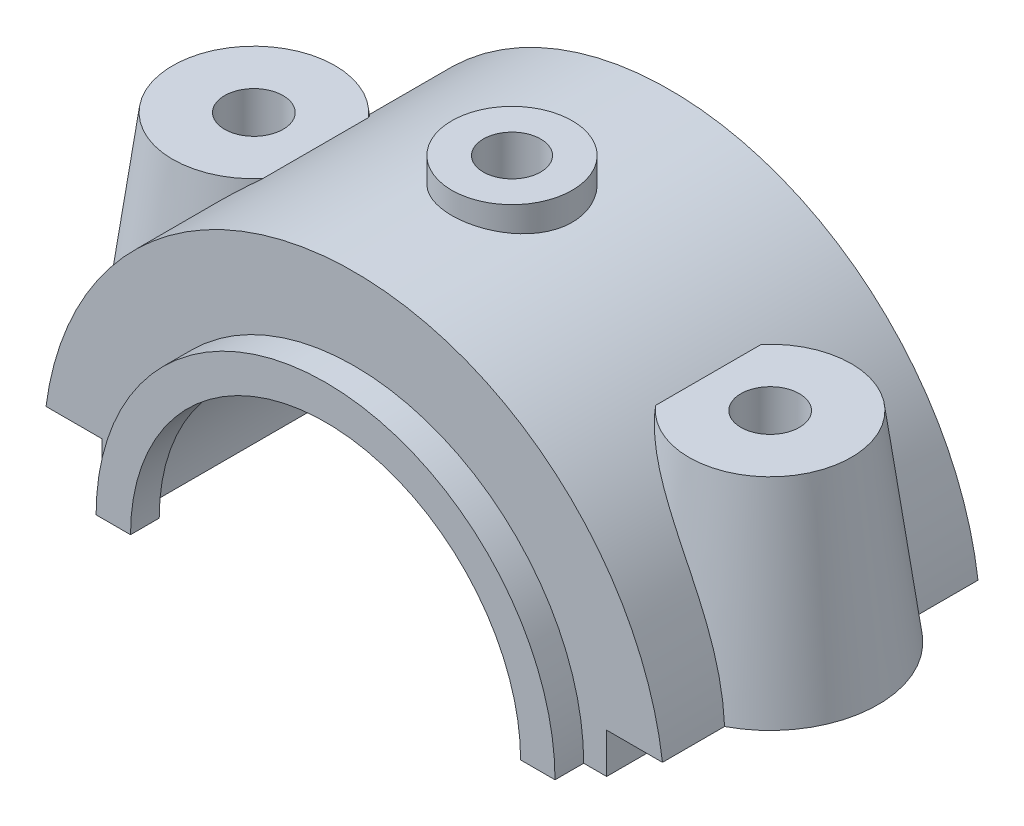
ISO-10303-21;
HEADER;
FILE_DESCRIPTION(('STEP AP214'),'2;1');
FILE_NAME('part.step','',(''),(''),'','','');
FILE_SCHEMA(('AUTOMOTIVE_DESIGN { 1 0 10303 214 1 1 1 1 }'));
ENDSEC;
DATA;
#1=APPLICATION_CONTEXT('core data for automotive mechanical design processes');
#2=APPLICATION_PROTOCOL_DEFINITION('international standard','automotive_design',2000,#1);
#3=PRODUCT_CONTEXT('',#1,'mechanical');
#4=PRODUCT('Part','Part','',(#3));
#5=PRODUCT_RELATED_PRODUCT_CATEGORY('part','',(#4));
#6=PRODUCT_DEFINITION_FORMATION('','',#4);
#7=PRODUCT_DEFINITION_CONTEXT('part definition',#1,'design');
#8=PRODUCT_DEFINITION('design','',#6,#7);
#9=PRODUCT_DEFINITION_SHAPE('','',#8);
#10=(LENGTH_UNIT() NAMED_UNIT(*) SI_UNIT(.MILLI.,.METRE.));
#11=(NAMED_UNIT(*) PLANE_ANGLE_UNIT() SI_UNIT($,.RADIAN.));
#12=(NAMED_UNIT(*) SI_UNIT($,.STERADIAN.) SOLID_ANGLE_UNIT());
#13=UNCERTAINTY_MEASURE_WITH_UNIT(LENGTH_MEASURE(1.E-05),#10,'distance_accuracy_value','');
#14=(GEOMETRIC_REPRESENTATION_CONTEXT(3) GLOBAL_UNCERTAINTY_ASSIGNED_CONTEXT((#13)) GLOBAL_UNIT_ASSIGNED_CONTEXT((#10,
#11,#12)) REPRESENTATION_CONTEXT('',''));
#15=CARTESIAN_POINT('',(0.,0.,0.));
#16=DIRECTION('',(0.,0.,1.));
#17=DIRECTION('',(1.,0.,0.));
#18=AXIS2_PLACEMENT_3D('',#15,#16,#17);
#19=CARTESIAN_POINT('',(0.,70.,-79.8259018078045));
#20=DIRECTION('',(0.,0.,1.));
#21=DIRECTION('',(1.,0.,0.));
#22=AXIS2_PLACEMENT_3D('',#19,#20,#21);
#23=CYLINDRICAL_SURFACE('',#22,37.);
#24=CARTESIAN_POINT('',(0.,70.,-27.5));
#25=DIRECTION('',(0.,0.,1.));
#26=DIRECTION('',(1.,0.,0.));
#27=AXIS2_PLACEMENT_3D('',#24,#25,#26);
#28=CIRCLE('',#27,37.);
#29=CARTESIAN_POINT('',(-37.,70.,-27.5));
#30=VERTEX_POINT('',#29);
#31=CARTESIAN_POINT('',(37.,70.,-27.5));
#32=VERTEX_POINT('',#31);
#33=EDGE_CURVE('E212',#30,#32,#28,.F.);
#34=ORIENTED_EDGE('',*,*,#33,.T.);
#35=DIRECTION('',(0.,0.,1.));
#36=VECTOR('',#35,1.);
#37=CARTESIAN_POINT('',(37.,70.,-79.8259018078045));
#38=LINE('',#37,#36);
#39=CARTESIAN_POINT('',(37.,70.,27.5));
#40=VERTEX_POINT('',#39);
#41=EDGE_CURVE('E209',#32,#40,#38,.T.);
#42=ORIENTED_EDGE('',*,*,#41,.T.);
#43=CARTESIAN_POINT('',(0.,70.,27.5));
#44=DIRECTION('',(0.,0.,1.));
#45=DIRECTION('',(1.,0.,0.));
#46=AXIS2_PLACEMENT_3D('',#43,#44,#45);
#47=CIRCLE('',#46,37.);
#48=CARTESIAN_POINT('',(-37.,70.,27.5));
#49=VERTEX_POINT('',#48);
#50=EDGE_CURVE('E196',#40,#49,#47,.T.);
#51=ORIENTED_EDGE('',*,*,#50,.T.);
#52=DIRECTION('',(0.,0.,1.));
#53=VECTOR('',#52,1.);
#54=CARTESIAN_POINT('',(-37.,70.,-79.8259018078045));
#55=LINE('',#54,#53);
#56=EDGE_CURVE('E206',#30,#49,#55,.T.);
#57=ORIENTED_EDGE('',*,*,#56,.F.);
#58=EDGE_LOOP('',(#34,#42,#51,#57));
#59=FACE_BOUND('',#58,.T.);
#60=CARTESIAN_POINT('',(3.,106.878177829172,0.));
#61=CARTESIAN_POINT('',(2.99999264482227,106.878179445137,0.168213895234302));
#62=CARTESIAN_POINT('',(2.98580445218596,106.879341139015,0.336542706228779));
#63=CARTESIAN_POINT('',(2.92941327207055,106.883862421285,0.668544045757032));
#64=CARTESIAN_POINT('',(2.88717843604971,106.887224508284,0.832211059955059));
#65=CARTESIAN_POINT('',(2.77592245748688,106.895763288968,1.15003218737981));
#66=CARTESIAN_POINT('',(2.70691637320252,106.900938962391,1.30419159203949));
#67=CARTESIAN_POINT('',(2.54410322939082,106.912520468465,1.59870233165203));
#68=CARTESIAN_POINT('',(2.45030151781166,106.91892603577,1.73905663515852));
#69=CARTESIAN_POINT('',(2.24031246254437,106.932263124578,2.0023522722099));
#70=CARTESIAN_POINT('',(2.12407719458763,106.939195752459,2.12525533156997));
#71=CARTESIAN_POINT('',(1.87262171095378,106.952795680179,2.34983102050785));
#72=CARTESIAN_POINT('',(1.73740067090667,106.959462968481,2.45150272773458));
#73=CARTESIAN_POINT('',(1.45158488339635,106.971791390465,2.63085609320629));
#74=CARTESIAN_POINT('',(1.30096937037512,106.977451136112,2.70850476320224));
#75=CARTESIAN_POINT('',(0.988784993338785,106.987114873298,2.83739687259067));
#76=CARTESIAN_POINT('',(0.827216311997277,106.991118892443,2.8886407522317));
#77=CARTESIAN_POINT('',(0.498091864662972,106.997012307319,2.96315883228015));
#78=CARTESIAN_POINT('',(0.330550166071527,106.998906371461,2.98649478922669));
#79=CARTESIAN_POINT('',(-0.00608201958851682,107.000382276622,3.00472548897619));
#80=CARTESIAN_POINT('',(-0.175172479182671,106.99996415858,2.99962073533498));
#81=CARTESIAN_POINT('',(-0.509683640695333,106.996866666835,2.96116547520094));
#82=CARTESIAN_POINT('',(-0.675112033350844,106.994192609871,2.92788138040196));
#83=CARTESIAN_POINT('',(-0.998026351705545,106.986890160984,2.83411549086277));
#84=CARTESIAN_POINT('',(-1.15551220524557,106.98226175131,2.7736334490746));
#85=CARTESIAN_POINT('',(-1.45828255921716,106.97156220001,2.62711436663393));
#86=CARTESIAN_POINT('',(-1.60355258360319,106.965489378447,2.54104753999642));
#87=CARTESIAN_POINT('',(-1.87760958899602,106.952583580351,2.34582363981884));
#88=CARTESIAN_POINT('',(-2.00639625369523,106.945750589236,2.23666612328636));
#89=CARTESIAN_POINT('',(-2.24421897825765,106.932069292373,1.99798502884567));
#90=CARTESIAN_POINT('',(-2.35319713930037,106.925220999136,1.86840375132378));
#91=CARTESIAN_POINT('',(-2.54786216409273,106.912300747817,1.59275468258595));
#92=CARTESIAN_POINT('',(-2.63354901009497,106.906228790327,1.44668687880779));
#93=CARTESIAN_POINT('',(-2.77919663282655,106.895547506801,1.14217090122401));
#94=CARTESIAN_POINT('',(-2.83915447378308,106.890938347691,0.983721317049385));
#95=CARTESIAN_POINT('',(-2.93159959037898,106.883707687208,0.658958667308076));
#96=CARTESIAN_POINT('',(-2.96408741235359,106.881086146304,0.49264575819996));
#97=CARTESIAN_POINT('',(-3.00059712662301,106.878133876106,0.157383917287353));
#98=CARTESIAN_POINT('',(-3.00469972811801,106.877796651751,-0.0115561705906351));
#99=CARTESIAN_POINT('',(-2.98453389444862,106.879434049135,-0.34772173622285));
#100=CARTESIAN_POINT('',(-2.96026570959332,106.881408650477,-0.514947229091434));
#101=CARTESIAN_POINT('',(-2.88411444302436,106.887441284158,-0.842705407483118));
#102=CARTESIAN_POINT('',(-2.83226896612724,106.891496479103,-1.00324688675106));
#103=CARTESIAN_POINT('',(-2.70247302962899,106.901231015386,-1.31335213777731));
#104=CARTESIAN_POINT('',(-2.62452217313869,106.906910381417,-1.46291574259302));
#105=CARTESIAN_POINT('',(-2.44452374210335,106.919269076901,-1.74718918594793));
#106=CARTESIAN_POINT('',(-2.3424223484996,106.925950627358,-1.88186484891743));
#107=CARTESIAN_POINT('',(-2.11709892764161,106.939553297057,-2.13219419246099));
#108=CARTESIAN_POINT('',(-1.99387655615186,106.946474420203,-2.24784756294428));
#109=CARTESIAN_POINT('',(-1.72946041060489,106.95979569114,-2.45712448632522));
#110=CARTESIAN_POINT('',(-1.58822508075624,106.966194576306,-2.55069562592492));
#111=CARTESIAN_POINT('',(-1.29199945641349,106.977732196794,-2.71279243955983));
#112=CARTESIAN_POINT('',(-1.1370092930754,106.982870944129,-2.78131835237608));
#113=CARTESIAN_POINT('',(-0.81786200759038,106.991303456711,-2.89128935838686));
#114=CARTESIAN_POINT('',(-0.653716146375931,106.994599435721,-2.9327669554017));
#115=CARTESIAN_POINT('',(-0.320762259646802,106.998984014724,-2.98757018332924));
#116=CARTESIAN_POINT('',(-0.15195431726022,107.00007265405,-3.00089631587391));
#117=CARTESIAN_POINT('',(0.185015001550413,106.999919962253,-2.99901261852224));
#118=CARTESIAN_POINT('',(0.353176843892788,106.998685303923,-2.98388451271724));
#119=CARTESIAN_POINT('',(0.684563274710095,106.994037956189,-2.9256920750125));
#120=CARTESIAN_POINT('',(0.847787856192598,106.990625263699,-2.88262770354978));
#121=CARTESIAN_POINT('',(1.16467249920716,106.982004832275,-2.76980569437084));
#122=CARTESIAN_POINT('',(1.31833304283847,106.976797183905,-2.70004940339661));
#123=CARTESIAN_POINT('',(1.61177504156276,106.965169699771,-2.53583319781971));
#124=CARTESIAN_POINT('',(1.75155673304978,106.958749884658,-2.44137370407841));
#125=CARTESIAN_POINT('',(2.01369114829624,106.945396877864,-2.23012590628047));
#126=CARTESIAN_POINT('',(2.13599514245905,106.938462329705,-2.11327722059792));
#127=CARTESIAN_POINT('',(2.35930281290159,106.924872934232,-1.86067500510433));
#128=CARTESIAN_POINT('',(2.46030131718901,106.918218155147,-1.72491689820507));
#129=CARTESIAN_POINT('',(2.63826002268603,106.905928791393,-1.4380994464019));
#130=CARTESIAN_POINT('',(2.71517675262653,106.900296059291,-1.2870130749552));
#131=CARTESIAN_POINT('',(2.84245220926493,106.890711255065,-0.974128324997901));
#132=CARTESIAN_POINT('',(2.89284153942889,106.886757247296,-0.81234253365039));
#133=CARTESIAN_POINT('',(2.95276607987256,106.88199684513,-0.541331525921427));
#134=CARTESIAN_POINT('',(2.97045533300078,106.880571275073,-0.433850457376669));
#135=CARTESIAN_POINT('',(2.99407465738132,106.878661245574,-0.217595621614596));
#136=CARTESIAN_POINT('',(3.00000475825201,106.878176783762,-0.108821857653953));
#137=CARTESIAN_POINT('',(3.,106.878177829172,0.));
#138=B_SPLINE_CURVE_WITH_KNOTS('',3,(#60,#61,#62,#63,#64,#65,#66,#67,#68,#69,#70,#71,#72,#73,
#74,#75,#76,#77,#78,#79,#80,#81,#82,#83,#84,#85,#86,#87,#88,#89,#90,#91,#92,#93,#94,#95,#96,#97,
#98,#99,#100,#101,#102,#103,#104,#105,#106,#107,#108,#109,#110,#111,#112,#113,#114,#115,#116,
#117,#118,#119,#120,#121,#122,#123,#124,#125,#126,#127,#128,#129,#130,#131,#132,#133,#134,#135,
#136,#137),.UNSPECIFIED.,.T.,.F.,(4,2,2,2,2,2,2,2,2,2,2,2,2,2,2,2,2,2,2,2,2,2,2,2,2,2,2,2,2,2,2,
2,2,2,2,2,2,2,4),(0.,0.504244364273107,1.00906230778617,1.5135967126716,2.0180223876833,
2.52353782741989,3.02907522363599,3.53530376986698,4.04152387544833,4.5466216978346,
5.05171057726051,5.5556123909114,6.05951878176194,6.5640141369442,7.06851917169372,
7.57447592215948,8.0804330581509,8.58644791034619,9.09245269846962,9.59701814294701,
10.1015791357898,10.6054538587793,11.1093362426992,11.6143522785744,12.119376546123,
12.6255877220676,13.1317940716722,13.6373909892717,14.1429788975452,14.6471169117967,
15.1512556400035,15.6553689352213,16.1594736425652,16.6649575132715,17.1705639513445,
17.6770778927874,18.1830062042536,18.5092155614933,18.835424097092),.UNSPECIFIED.);
#139=CARTESIAN_POINT('',(3.,106.878177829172,0.));
#140=VERTEX_POINT('',#139);
#141=EDGE_CURVE('E36',#140,#140,#138,.T.);
#142=ORIENTED_EDGE('',*,*,#141,.F.);
#143=EDGE_LOOP('',(#142));
#144=FACE_BOUND('',#143,.T.);
#145=ADVANCED_FACE('F31',(#59,#144),#23,.F.);
#146=CARTESIAN_POINT('',(0.,70.,89.0685424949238));
#147=DIRECTION('',(0.,0.,-1.));
#148=DIRECTION('',(-1.,0.,0.));
#149=AXIS2_PLACEMENT_3D('',#146,#147,#148);
#150=CYLINDRICAL_SURFACE('',#149,34.);
#151=CARTESIAN_POINT('',(0.,70.,-27.5));
#152=DIRECTION('',(0.,0.,1.));
#153=DIRECTION('',(1.,0.,0.));
#154=AXIS2_PLACEMENT_3D('',#151,#152,#153);
#155=CIRCLE('',#154,34.);
#156=CARTESIAN_POINT('',(-34.,70.,-27.5));
#157=VERTEX_POINT('',#156);
#158=CARTESIAN_POINT('',(34.,70.,-27.5));
#159=VERTEX_POINT('',#158);
#160=EDGE_CURVE('E326',#157,#159,#155,.F.);
#161=ORIENTED_EDGE('',*,*,#160,.F.);
#162=DIRECTION('',(0.,0.,-1.));
#163=VECTOR('',#162,1.);
#164=CARTESIAN_POINT('',(-34.,70.,89.0685424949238));
#165=LINE('',#164,#163);
#166=CARTESIAN_POINT('',(-34.,70.,-32.5));
#167=VERTEX_POINT('',#166);
#168=EDGE_CURVE('E455',#157,#167,#165,.T.);
#169=ORIENTED_EDGE('',*,*,#168,.T.);
#170=CARTESIAN_POINT('',(0.,70.,-32.5));
#171=DIRECTION('',(0.,0.,1.));
#172=DIRECTION('',(1.,0.,0.));
#173=AXIS2_PLACEMENT_3D('',#170,#171,#172);
#174=CIRCLE('',#173,34.);
#175=CARTESIAN_POINT('',(34.,70.,-32.5));
#176=VERTEX_POINT('',#175);
#177=EDGE_CURVE('E435',#176,#167,#174,.T.);
#178=ORIENTED_EDGE('',*,*,#177,.F.);
#179=DIRECTION('',(0.,0.,-1.));
#180=VECTOR('',#179,1.);
#181=CARTESIAN_POINT('',(34.,70.,89.0685424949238));
#182=LINE('',#181,#180);
#183=EDGE_CURVE('E368',#159,#176,#182,.T.);
#184=ORIENTED_EDGE('',*,*,#183,.F.);
#185=EDGE_LOOP('',(#161,#169,#178,#184));
#186=FACE_BOUND('',#185,.T.);
#187=ADVANCED_FACE('F280',(#186),#150,.F.);
#188=CARTESIAN_POINT('',(-44.,70.,27.5));
#189=DIRECTION('',(0.,1.,0.));
#190=DIRECTION('',(-1.,0.,0.));
#191=AXIS2_PLACEMENT_3D('',#188,#189,#190);
#192=PLANE('',#191);
#193=DIRECTION('',(-1.,0.,0.));
#194=VECTOR('',#193,1.);
#195=CARTESIAN_POINT('',(0.,70.,-27.5));
#196=LINE('',#195,#194);
#197=EDGE_CURVE('E331',#157,#30,#196,.T.);
#198=ORIENTED_EDGE('',*,*,#197,.T.);
#199=ORIENTED_EDGE('',*,*,#56,.T.);
#200=DIRECTION('',(1.,0.,0.));
#201=VECTOR('',#200,1.);
#202=CARTESIAN_POINT('',(0.,70.,27.5));
#203=LINE('',#202,#201);
#204=CARTESIAN_POINT('',(-34.,70.,27.5));
#205=VERTEX_POINT('',#204);
#206=EDGE_CURVE('E203',#49,#205,#203,.T.);
#207=ORIENTED_EDGE('',*,*,#206,.T.);
#208=CARTESIAN_POINT('',(-34.,70.,32.5));
#209=VERTEX_POINT('',#208);
#210=EDGE_CURVE('E451',#209,#205,#165,.T.);
#211=ORIENTED_EDGE('',*,*,#210,.F.);
#212=DIRECTION('',(1.,0.,0.));
#213=VECTOR('',#212,1.);
#214=CARTESIAN_POINT('',(-40.,70.,32.5));
#215=LINE('',#214,#213);
#216=CARTESIAN_POINT('',(-40.,70.,32.5));
#217=VERTEX_POINT('',#216);
#218=EDGE_CURVE('E405',#217,#209,#215,.T.);
#219=ORIENTED_EDGE('',*,*,#218,.F.);
#220=DIRECTION('',(0.,0.,-1.));
#221=VECTOR('',#220,1.);
#222=CARTESIAN_POINT('',(-40.,70.,89.0685424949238));
#223=LINE('',#222,#221);
#224=CARTESIAN_POINT('',(-40.,70.,27.5));
#225=VERTEX_POINT('',#224);
#226=EDGE_CURVE('E452',#217,#225,#223,.T.);
#227=ORIENTED_EDGE('',*,*,#226,.T.);
#228=DIRECTION('',(1.,0.,0.));
#229=VECTOR('',#228,1.);
#230=CARTESIAN_POINT('',(-44.,70.,27.5));
#231=LINE('',#230,#229);
#232=CARTESIAN_POINT('',(-44.,70.,27.5));
#233=VERTEX_POINT('',#232);
#234=EDGE_CURVE('E463',#233,#225,#231,.T.);
#235=ORIENTED_EDGE('',*,*,#234,.F.);
#236=DIRECTION('',(0.,0.,-1.));
#237=VECTOR('',#236,1.);
#238=CARTESIAN_POINT('',(-44.,70.,27.5));
#239=LINE('',#238,#237);
#240=CARTESIAN_POINT('',(-44.,70.,5.00099990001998));
#241=VERTEX_POINT('',#240);
#242=EDGE_CURVE('E418',#233,#241,#239,.T.);
#243=ORIENTED_EDGE('',*,*,#242,.T.);
#244=CARTESIAN_POINT('',(-45.,70.,0.));
#245=DIRECTION('',(0.,1.,0.));
#246=DIRECTION('',(0.,0.,1.));
#247=AXIS2_PLACEMENT_3D('',#244,#245,#246);
#248=CIRCLE('',#247,5.09999999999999);
#249=CARTESIAN_POINT('',(-44.,70.,-5.00099990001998));
#250=VERTEX_POINT('',#249);
#251=EDGE_CURVE('E324',#241,#250,#248,.T.);
#252=ORIENTED_EDGE('',*,*,#251,.T.);
#253=CARTESIAN_POINT('',(-44.,70.,-27.5));
#254=VERTEX_POINT('',#253);
#255=EDGE_CURVE('E422',#250,#254,#239,.T.);
#256=ORIENTED_EDGE('',*,*,#255,.T.);
#257=DIRECTION('',(1.,0.,0.));
#258=VECTOR('',#257,1.);
#259=CARTESIAN_POINT('',(-44.,70.,-27.5));
#260=LINE('',#259,#258);
#261=CARTESIAN_POINT('',(-40.,70.,-27.5));
#262=VERTEX_POINT('',#261);
#263=EDGE_CURVE('E413',#254,#262,#260,.T.);
#264=ORIENTED_EDGE('',*,*,#263,.T.);
#265=CARTESIAN_POINT('',(-40.,70.,-32.5));
#266=VERTEX_POINT('',#265);
#267=EDGE_CURVE('E444',#262,#266,#223,.T.);
#268=ORIENTED_EDGE('',*,*,#267,.T.);
#269=DIRECTION('',(-1.,0.,0.));
#270=VECTOR('',#269,1.);
#271=CARTESIAN_POINT('',(-40.,70.,-32.5));
#272=LINE('',#271,#270);
#273=EDGE_CURVE('E441',#167,#266,#272,.T.);
#274=ORIENTED_EDGE('',*,*,#273,.F.);
#275=ORIENTED_EDGE('',*,*,#168,.F.);
#276=EDGE_LOOP('',(#198,#199,#207,#211,#219,#227,#235,#243,#252,#256,#264,#268,#274,#275));
#277=FACE_BOUND('',#276,.T.);
#278=ADVANCED_FACE('F470',(#277),#192,.F.);
#279=CARTESIAN_POINT('',(-44.,77.,27.5));
#280=DIRECTION('',(1.,0.,0.));
#281=DIRECTION('',(0.,0.,-1.));
#282=AXIS2_PLACEMENT_3D('',#279,#280,#281);
#283=PLANE('',#282);
#284=ORIENTED_EDGE('',*,*,#255,.F.);
#285=DIRECTION('',(0.,1.,0.));
#286=VECTOR('',#285,1.);
#287=CARTESIAN_POINT('',(-44.,112.,-5.00099990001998));
#288=LINE('',#287,#286);
#289=CARTESIAN_POINT('',(-44.,77.,-5.00099990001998));
#290=VERTEX_POINT('',#289);
#291=EDGE_CURVE('E52',#250,#290,#288,.T.);
#292=ORIENTED_EDGE('',*,*,#291,.T.);
#293=DIRECTION('',(0.,0.,-1.));
#294=VECTOR('',#293,1.);
#295=CARTESIAN_POINT('',(-44.,77.,27.5));
#296=LINE('',#295,#294);
#297=CARTESIAN_POINT('',(-44.,77.,-27.5));
#298=VERTEX_POINT('',#297);
#299=EDGE_CURVE('E421',#290,#298,#296,.T.);
#300=ORIENTED_EDGE('',*,*,#299,.T.);
#301=DIRECTION('',(0.,-1.,0.));
#302=VECTOR('',#301,1.);
#303=CARTESIAN_POINT('',(-44.,77.,-27.5));
#304=LINE('',#303,#302);
#305=EDGE_CURVE('E403',#298,#254,#304,.T.);
#306=ORIENTED_EDGE('',*,*,#305,.T.);
#307=EDGE_LOOP('',(#284,#292,#300,#306));
#308=FACE_BOUND('',#307,.T.);
#309=ADVANCED_FACE('F474',(#308),#283,.F.);
#310=CARTESIAN_POINT('',(0.,70.,27.5));
#311=DIRECTION('',(0.,0.,-1.));
#312=DIRECTION('',(-1.,0.,0.));
#313=AXIS2_PLACEMENT_3D('',#310,#311,#312);
#314=CYLINDRICAL_SURFACE('',#313,54.1873704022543);
#315=CARTESIAN_POINT('',(0.,124.187370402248,10.5));
#316=CARTESIAN_POINT('',(0.292065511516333,124.187373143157,10.5000055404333));
#317=CARTESIAN_POINT('',(0.584060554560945,124.18500494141,10.4878106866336));
#318=CARTESIAN_POINT('',(1.16603203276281,124.175604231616,10.4391378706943));
#319=CARTESIAN_POINT('',(1.45600810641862,124.16857090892,10.4026556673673));
#320=CARTESIAN_POINT('',(2.03196741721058,124.150026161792,10.3056524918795));
#321=CARTESIAN_POINT('',(2.31794765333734,124.138511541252,10.2451143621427));
#322=CARTESIAN_POINT('',(2.88368955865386,124.111326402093,10.1004741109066));
#323=CARTESIAN_POINT('',(3.16345110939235,124.095655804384,10.0163715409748));
#324=CARTESIAN_POINT('',(3.71452341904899,124.060610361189,9.82533872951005));
#325=CARTESIAN_POINT('',(3.98584203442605,124.041239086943,9.71843048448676));
#326=CARTESIAN_POINT('',(4.51844917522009,123.999315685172,9.48253384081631));
#327=CARTESIAN_POINT('',(4.77973760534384,123.976763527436,9.35354523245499));
#328=CARTESIAN_POINT('',(5.2904515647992,123.929101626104,9.07445764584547));
#329=CARTESIAN_POINT('',(5.53988009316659,123.903992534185,8.92436404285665));
#330=CARTESIAN_POINT('',(6.02536386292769,123.851887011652,8.60404524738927));
#331=CARTESIAN_POINT('',(6.26141467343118,123.824889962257,8.43381344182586));
#332=CARTESIAN_POINT('',(6.72107275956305,123.769438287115,8.07239844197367));
#333=CARTESIAN_POINT('',(6.94450990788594,123.740970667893,7.88100083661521));
#334=CARTESIAN_POINT('',(7.37451800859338,123.683653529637,7.48016577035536));
#335=CARTESIAN_POINT('',(7.58108884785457,123.654804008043,7.27072818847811));
#336=CARTESIAN_POINT('',(7.97601250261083,123.597520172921,6.83517828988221));
#337=CARTESIAN_POINT('',(8.16436076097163,123.569085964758,6.60906182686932));
#338=CARTESIAN_POINT('',(8.52142177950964,123.513448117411,6.14180720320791));
#339=CARTESIAN_POINT('',(8.69014138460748,123.486244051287,5.9006743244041));
#340=CARTESIAN_POINT('',(9.00821488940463,123.433598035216,5.40278495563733));
#341=CARTESIAN_POINT('',(9.15738761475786,123.408173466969,5.14591083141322));
#342=CARTESIAN_POINT('',(9.43353152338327,123.360090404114,4.62024120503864));
#343=CARTESIAN_POINT('',(9.5605025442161,123.337431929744,4.3514456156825));
#344=CARTESIAN_POINT('',(9.79127301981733,123.295551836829,3.80384607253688));
#345=CARTESIAN_POINT('',(9.89507413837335,123.276329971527,3.52504283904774));
#346=CARTESIAN_POINT('',(10.0787055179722,123.241896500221,2.95940981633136));
#347=CARTESIAN_POINT('',(10.1585361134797,123.226684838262,2.67258013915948));
#348=CARTESIAN_POINT('',(10.2927551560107,123.200892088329,2.09656012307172));
#349=CARTESIAN_POINT('',(10.3474451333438,123.190256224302,1.80744248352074));
#350=CARTESIAN_POINT('',(10.4323822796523,123.173662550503,1.22550537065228));
#351=CARTESIAN_POINT('',(10.4626296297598,123.167704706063,0.932685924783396));
#352=CARTESIAN_POINT('',(10.4984347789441,123.160646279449,0.345507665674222));
#353=CARTESIAN_POINT('',(10.5039946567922,123.15954528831,0.05114898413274));
#354=CARTESIAN_POINT('',(10.4903849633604,123.162232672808,-0.536972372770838));
#355=CARTESIAN_POINT('',(10.4712155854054,123.166021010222,-0.830735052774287));
#356=CARTESIAN_POINT('',(10.4087496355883,123.178285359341,-1.41137768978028));
#357=CARTESIAN_POINT('',(10.3657978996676,123.186694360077,-1.69829624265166));
#358=CARTESIAN_POINT('',(10.2563493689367,123.207908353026,-2.26743723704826));
#359=CARTESIAN_POINT('',(10.1898528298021,123.220713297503,-2.54965972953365));
#360=CARTESIAN_POINT('',(10.0338232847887,123.250350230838,-3.10745299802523));
#361=CARTESIAN_POINT('',(9.94428956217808,123.267182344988,-3.38302356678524));
#362=CARTESIAN_POINT('',(9.7428574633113,123.304393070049,-3.92561803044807));
#363=CARTESIAN_POINT('',(9.63095886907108,123.324771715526,-4.19264184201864));
#364=CARTESIAN_POINT('',(9.38485428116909,123.368636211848,-4.71796158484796));
#365=CARTESIAN_POINT('',(9.2505147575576,123.392140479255,-4.97619341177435));
#366=CARTESIAN_POINT('',(8.96092791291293,123.441504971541,-5.48054393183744));
#367=CARTESIAN_POINT('',(8.80567280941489,123.467366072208,-5.72665806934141));
#368=CARTESIAN_POINT('',(8.47542662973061,123.520708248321,-6.2049638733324));
#369=CARTESIAN_POINT('',(8.30044182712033,123.548188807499,-6.43715992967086));
#370=CARTESIAN_POINT('',(7.93180180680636,123.604033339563,-6.88628807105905));
#371=CARTESIAN_POINT('',(7.73813808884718,123.632397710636,-7.10321312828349));
#372=CARTESIAN_POINT('',(7.33008016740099,123.689702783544,-7.52377639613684));
#373=CARTESIAN_POINT('',(7.11539120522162,123.718645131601,-7.72712850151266));
#374=CARTESIAN_POINT('',(6.66967722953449,123.775802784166,-8.11496379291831));
#375=CARTESIAN_POINT('',(6.43865949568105,123.804018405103,-8.29945529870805));
#376=CARTESIAN_POINT('',(5.96166994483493,123.858957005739,-8.64845990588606));
#377=CARTESIAN_POINT('',(5.71569164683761,123.885679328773,-8.81296425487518));
#378=CARTESIAN_POINT('',(5.21065402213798,123.936857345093,-9.12066254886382));
#379=CARTESIAN_POINT('',(4.95159979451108,123.961313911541,-9.26386471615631));
#380=CARTESIAN_POINT('',(4.42168859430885,124.007320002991,-9.52819384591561));
#381=CARTESIAN_POINT('',(4.15081332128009,124.028864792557,-9.64928495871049));
#382=CARTESIAN_POINT('',(3.59955830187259,124.068388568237,-9.86818771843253));
#383=CARTESIAN_POINT('',(3.3191785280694,124.08636754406,-9.96599929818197));
#384=CARTESIAN_POINT('',(2.75095342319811,124.118243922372,-10.1375699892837));
#385=CARTESIAN_POINT('',(2.46310878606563,124.13214170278,-10.2113313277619));
#386=CARTESIAN_POINT('',(1.8820308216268,124.155457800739,-10.3342220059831));
#387=CARTESIAN_POINT('',(1.58879757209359,124.164876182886,-10.3833517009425));
#388=CARTESIAN_POINT('',(1.00375484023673,124.178850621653,-10.4560027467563));
#389=CARTESIAN_POINT('',(0.711995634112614,124.183480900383,-10.4799151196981));
#390=CARTESIAN_POINT('',(0.127464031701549,124.188008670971,-10.5032997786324));
#391=CARTESIAN_POINT('',(-0.165308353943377,124.187906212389,-10.5027723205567));
#392=CARTESIAN_POINT('',(-0.749731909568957,124.182971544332,-10.4772825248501));
#393=CARTESIAN_POINT('',(-1.04138313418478,124.17813956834,-10.4523213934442));
#394=CARTESIAN_POINT('',(-1.62147346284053,124.163882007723,-10.3781657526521));
#395=CARTESIAN_POINT('',(-1.90991257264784,124.154456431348,-10.3289712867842));
#396=CARTESIAN_POINT('',(-2.4791078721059,124.131373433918,-10.207252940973));
#397=CARTESIAN_POINT('',(-2.75990827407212,124.117752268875,-10.1349287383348));
#398=CARTESIAN_POINT('',(-3.3143692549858,124.086626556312,-9.96738835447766));
#399=CARTESIAN_POINT('',(-3.5880298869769,124.069122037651,-9.87217234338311));
#400=CARTESIAN_POINT('',(-4.12631162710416,124.030708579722,-9.65956938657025));
#401=CARTESIAN_POINT('',(-4.39093378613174,124.009800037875,-9.54218502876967));
#402=CARTESIAN_POINT('',(-4.90948598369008,123.965135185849,-9.28604356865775));
#403=CARTESIAN_POINT('',(-5.16341221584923,123.941377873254,-9.14727893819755));
#404=CARTESIAN_POINT('',(-5.66162112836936,123.891377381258,-8.84768324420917));
#405=CARTESIAN_POINT('',(-5.90576080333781,123.865108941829,-8.68661857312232));
#406=CARTESIAN_POINT('',(-6.3796516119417,123.811040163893,-8.34478306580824));
#407=CARTESIAN_POINT('',(-6.60940255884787,123.783239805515,-8.16401197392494));
#408=CARTESIAN_POINT('',(-7.0530423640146,123.726862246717,-7.78395337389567));
#409=CARTESIAN_POINT('',(-7.26692712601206,123.698284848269,-7.58466111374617));
#410=CARTESIAN_POINT('',(-7.67727260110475,123.641154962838,-7.16901281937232));
#411=CARTESIAN_POINT('',(-7.87373915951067,123.612602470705,-6.95266255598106));
#412=CARTESIAN_POINT('',(-8.25071102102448,123.555893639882,-6.50104043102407));
#413=CARTESIAN_POINT('',(-8.43094499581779,123.527748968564,-6.26554052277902));
#414=CARTESIAN_POINT('',(-8.77093468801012,123.47309112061,-5.78001199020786));
#415=CARTESIAN_POINT('',(-8.93069018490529,123.446577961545,-5.52998320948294));
#416=CARTESIAN_POINT('',(-9.22856322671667,123.395950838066,-5.01712613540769));
#417=CARTESIAN_POINT('',(-9.36668130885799,123.371836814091,-4.75429816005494));
#418=CARTESIAN_POINT('',(-9.62025533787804,123.326713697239,-4.2176713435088));
#419=CARTESIAN_POINT('',(-9.73571149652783,123.305704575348,-3.94387260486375));
#420=CARTESIAN_POINT('',(-9.94255209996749,123.267511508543,-3.38865384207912));
#421=CARTESIAN_POINT('',(-10.0340554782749,123.250308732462,-3.10727943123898));
#422=CARTESIAN_POINT('',(-10.1930385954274,123.220105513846,-2.53760013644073));
#423=CARTESIAN_POINT('',(-10.260518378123,123.20710506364,-2.24929526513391));
#424=CARTESIAN_POINT('',(-10.3709075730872,123.185698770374,-1.66788014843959));
#425=CARTESIAN_POINT('',(-10.4138194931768,123.17729245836,-1.37477039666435));
#426=CARTESIAN_POINT('',(-10.4747324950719,123.165327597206,-0.78587669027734));
#427=CARTESIAN_POINT('',(-10.4927339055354,123.161768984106,-0.490092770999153));
#428=CARTESIAN_POINT('',(-10.5035856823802,123.159625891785,0.0969146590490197));
#429=CARTESIAN_POINT('',(-10.4968587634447,123.160957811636,0.388130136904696));
#430=CARTESIAN_POINT('',(-10.4592472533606,123.168370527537,0.968933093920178));
#431=CARTESIAN_POINT('',(-10.428362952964,123.174451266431,1.25852059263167));
#432=CARTESIAN_POINT('',(-10.3426826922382,123.191182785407,1.83399663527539));
#433=CARTESIAN_POINT('',(-10.2878870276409,123.201833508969,2.11988522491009));
#434=CARTESIAN_POINT('',(-10.1548125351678,123.227394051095,2.68594816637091));
#435=CARTESIAN_POINT('',(-10.0765336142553,123.242303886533,2.96612249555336));
#436=CARTESIAN_POINT('',(-9.8972851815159,123.275915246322,3.51820962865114));
#437=CARTESIAN_POINT('',(-9.79636486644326,123.294608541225,3.79013891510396));
#438=CARTESIAN_POINT('',(-9.57248778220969,123.335274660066,4.32451123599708));
#439=CARTESIAN_POINT('',(-9.44953108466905,123.357247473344,4.58695430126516));
#440=CARTESIAN_POINT('',(-9.18248788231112,123.403851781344,5.10055669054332));
#441=CARTESIAN_POINT('',(-9.03840479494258,123.428482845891,5.35171783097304));
#442=CARTESIAN_POINT('',(-8.73003254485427,123.479735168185,5.84125471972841));
#443=CARTESIAN_POINT('',(-8.56573429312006,123.506357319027,6.07962464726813));
#444=CARTESIAN_POINT('',(-8.2153225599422,123.561287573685,6.54559424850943));
#445=CARTESIAN_POINT('',(-8.02890259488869,123.58961581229,6.77296113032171));
#446=CARTESIAN_POINT('',(-7.63777663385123,123.646756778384,7.21114277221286));
#447=CARTESIAN_POINT('',(-7.43307820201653,123.675569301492,7.42196431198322));
#448=CARTESIAN_POINT('',(-7.00662039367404,123.732901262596,7.82582583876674));
#449=CARTESIAN_POINT('',(-6.78485351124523,123.761420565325,8.01885791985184));
#450=CARTESIAN_POINT('',(-6.32583437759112,123.817361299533,8.38571044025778));
#451=CARTESIAN_POINT('',(-6.08858225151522,123.844782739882,8.5595310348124));
#452=CARTESIAN_POINT('',(-5.59780307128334,123.898026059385,8.88834580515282));
#453=CARTESIAN_POINT('',(-5.34413979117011,123.923829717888,9.04313971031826));
#454=CARTESIAN_POINT('',(-4.82441784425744,123.972810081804,9.33076666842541));
#455=CARTESIAN_POINT('',(-4.5583593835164,123.995986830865,9.46360008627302));
#456=CARTESIAN_POINT('',(-4.01591743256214,124.039036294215,9.70621413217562));
#457=CARTESIAN_POINT('',(-3.73954238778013,124.058911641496,9.81601314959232));
#458=CARTESIAN_POINT('',(-3.17834239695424,124.094809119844,10.0118175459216));
#459=CARTESIAN_POINT('',(-2.8935191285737,124.11083201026,10.0978276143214));
#460=CARTESIAN_POINT('',(-2.18069080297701,124.145139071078,10.280400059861));
#461=CARTESIAN_POINT('',(-1.74880900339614,124.160895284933,10.3626406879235));
#462=CARTESIAN_POINT('',(-0.877898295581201,124.182008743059,10.4724357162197));
#463=CARTESIAN_POINT('',(-0.438869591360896,124.187366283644,10.4999916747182));
#464=CARTESIAN_POINT('',(0.,124.187370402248,10.5));
#465=B_SPLINE_CURVE_WITH_KNOTS('',3,(#315,#316,#317,#318,#319,#320,#321,#322,#323,#324,#325,
#326,#327,#328,#329,#330,#331,#332,#333,#334,#335,#336,#337,#338,#339,#340,#341,#342,#343,#344,
#345,#346,#347,#348,#349,#350,#351,#352,#353,#354,#355,#356,#357,#358,#359,#360,#361,#362,#363,
#364,#365,#366,#367,#368,#369,#370,#371,#372,#373,#374,#375,#376,#377,#378,#379,#380,#381,#382,
#383,#384,#385,#386,#387,#388,#389,#390,#391,#392,#393,#394,#395,#396,#397,#398,#399,#400,#401,
#402,#403,#404,#405,#406,#407,#408,#409,#410,#411,#412,#413,#414,#415,#416,#417,#418,#419,#420,
#421,#422,#423,#424,#425,#426,#427,#428,#429,#430,#431,#432,#433,#434,#435,#436,#437,#438,#439,
#440,#441,#442,#443,#444,#445,#446,#447,#448,#449,#450,#451,#452,#453,#454,#455,#456,#457,#458,
#459,#460,#461,#462,#463,#464),.UNSPECIFIED.,.T.,.F.,(4,2,2,2,2,2,2,2,2,2,2,2,2,2,2,2,2,2,2,2,2,
2,2,2,2,2,2,2,2,2,2,2,2,2,2,2,2,2,2,2,2,2,2,2,2,2,2,2,2,2,2,2,2,2,2,2,2,2,2,2,2,2,2,2,2,2,2,2,2,
2,2,2,2,2,4),(0.,0.875811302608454,1.75177558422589,2.62836576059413,3.50497261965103,
4.38073776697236,5.25651123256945,6.13206204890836,7.00790118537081,7.89360645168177,
8.77931765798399,9.66524979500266,10.5508720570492,11.4441961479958,12.337526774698,
13.230793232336,14.1240472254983,15.0062887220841,15.8885236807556,16.7706843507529,
17.6528381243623,18.5225237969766,19.3922000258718,20.2619033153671,21.1316150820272,
22.0066993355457,22.8821101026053,23.7572432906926,24.632776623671,25.5230895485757,
26.4130080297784,27.3033148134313,28.1932770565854,29.0846696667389,29.9760648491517,
30.8673774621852,31.7586772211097,32.6359435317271,33.5132006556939,34.3904144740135,
35.2676267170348,36.1374616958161,37.0072902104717,37.8770172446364,38.747051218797,
39.6270074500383,40.5069750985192,41.387169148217,42.2670666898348,43.1596651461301,
44.0522732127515,44.9448591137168,45.8374366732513,46.7254944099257,47.6135505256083,
48.5015159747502,49.3894697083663,50.2623155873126,51.1351509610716,52.0079755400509,
52.8808035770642,53.7517531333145,54.622699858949,55.4935058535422,56.3647048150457,
57.2498166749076,58.1345639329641,59.019702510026,59.9048339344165,60.7986029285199,
61.6923570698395,62.5853949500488,63.4782566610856,64.7943240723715,66.1103539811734),.UNSPECIFIED.);
#466=CARTESIAN_POINT('',(0.,124.187370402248,10.5));
#467=VERTEX_POINT('',#466);
#468=EDGE_CURVE('E225',#467,#467,#465,.T.);
#469=ORIENTED_EDGE('',*,*,#468,.F.);
#470=EDGE_LOOP('',(#469));
#471=FACE_BOUND('',#470,.T.);
#472=CARTESIAN_POINT('',(-34.2381995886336,112.0002,-9.19519243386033));
#473=CARTESIAN_POINT('',(-34.3828651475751,111.88227249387,-9.388713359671));
#474=CARTESIAN_POINT('',(-34.5307776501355,111.760448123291,-9.57734399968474));
#475=CARTESIAN_POINT('',(-34.8322558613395,111.509318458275,-9.94476144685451));
#476=CARTESIAN_POINT('',(-34.9858201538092,111.380015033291,-10.1235506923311));
#477=CARTESIAN_POINT('',(-35.4531582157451,110.98184586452,-10.6444412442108));
#478=CARTESIAN_POINT('',(-35.7742172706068,110.702202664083,-10.9719122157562));
#479=CARTESIAN_POINT('',(-36.4249080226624,110.120880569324,-11.5839488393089));
#480=CARTESIAN_POINT('',(-36.7543678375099,109.81954606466,-11.8690293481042));
#481=CARTESIAN_POINT('',(-37.4208805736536,109.193851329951,-12.4031755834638));
#482=CARTESIAN_POINT('',(-37.7579379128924,108.869477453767,-12.6522196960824));
#483=CARTESIAN_POINT('',(-38.5409786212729,108.095330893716,-13.1888875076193));
#484=CARTESIAN_POINT('',(-38.9880312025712,107.638089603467,-13.4641840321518));
#485=CARTESIAN_POINT('',(-39.8788891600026,106.692881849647,-13.961840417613));
#486=CARTESIAN_POINT('',(-40.322693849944,106.204909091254,-14.1841893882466));
#487=CARTESIAN_POINT('',(-41.2032028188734,105.19966100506,-14.5833756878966));
#488=CARTESIAN_POINT('',(-41.6398557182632,104.682241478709,-14.7599603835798));
#489=CARTESIAN_POINT('',(-42.4991060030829,103.623831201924,-15.0725992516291));
#490=CARTESIAN_POINT('',(-42.9216979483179,103.082831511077,-15.2086378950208));
#491=CARTESIAN_POINT('',(-43.6798900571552,102.072848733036,-15.4264282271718));
#492=CARTESIAN_POINT('',(-44.018193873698,101.607003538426,-15.5134580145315));
#493=CARTESIAN_POINT('',(-44.6811846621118,100.66260937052,-15.6671405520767));
#494=CARTESIAN_POINT('',(-45.0058743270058,100.184062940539,-15.7337973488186));
#495=CARTESIAN_POINT('',(-45.6408601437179,99.2150445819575,-15.8500287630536));
#496=CARTESIAN_POINT('',(-45.9511461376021,98.7245645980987,-15.8995914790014));
#497=CARTESIAN_POINT('',(-46.5563108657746,97.7329844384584,-15.9846187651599));
#498=CARTESIAN_POINT('',(-46.8511888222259,97.2318837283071,-16.0200826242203));
#499=CARTESIAN_POINT('',(-47.4254033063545,96.219108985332,-16.0798193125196));
#500=CARTESIAN_POINT('',(-47.7047129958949,95.7074186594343,-16.1040733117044));
#501=CARTESIAN_POINT('',(-48.2467940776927,94.6750458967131,-16.1440042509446));
#502=CARTESIAN_POINT('',(-48.509565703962,94.1543635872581,-16.1596813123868));
#503=CARTESIAN_POINT('',(-49.0181592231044,93.1047870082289,-16.1849967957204));
#504=CARTESIAN_POINT('',(-49.2639847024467,92.5758945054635,-16.1946364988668));
#505=CARTESIAN_POINT('',(-49.7384544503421,91.5104013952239,-16.2102697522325));
#506=CARTESIAN_POINT('',(-49.9670984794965,90.9738006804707,-16.2162632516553));
#507=CARTESIAN_POINT('',(-50.4065499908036,89.8944649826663,-16.2268334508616));
#508=CARTESIAN_POINT('',(-50.6173890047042,89.3517428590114,-16.2314126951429));
#509=CARTESIAN_POINT('',(-51.0214661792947,88.2597920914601,-16.2412462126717));
#510=CARTESIAN_POINT('',(-51.2147043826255,87.7105634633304,-16.2465004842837));
#511=CARTESIAN_POINT('',(-51.5833574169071,86.6062390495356,-16.2596015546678));
#512=CARTESIAN_POINT('',(-51.7587738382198,86.0511437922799,-16.2674481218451));
#513=CARTESIAN_POINT('',(-52.091609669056,84.9356645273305,-16.2874758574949));
#514=CARTESIAN_POINT('',(-52.249029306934,84.3752805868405,-16.2996569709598));
#515=CARTESIAN_POINT('',(-52.5450633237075,83.2522889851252,-16.3298360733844));
#516=CARTESIAN_POINT('',(-52.6837554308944,82.689701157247,-16.3478089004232));
#517=CARTESIAN_POINT('',(-52.9429731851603,81.56063175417,-16.3908909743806));
#518=CARTESIAN_POINT('',(-53.0634991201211,80.9941502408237,-16.416000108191));
#519=CARTESIAN_POINT('',(-53.2863208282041,79.857713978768,-16.4744562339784));
#520=CARTESIAN_POINT('',(-53.3886067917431,79.2877575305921,-16.5078076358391));
#521=CARTESIAN_POINT('',(-53.5747947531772,78.145405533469,-16.5834997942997));
#522=CARTESIAN_POINT('',(-53.65869549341,77.5730098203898,-16.625841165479));
#523=CARTESIAN_POINT('',(-53.7333593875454,76.9998,-16.673054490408));
#524=B_SPLINE_CURVE_WITH_KNOTS('',3,(#472,#473,#474,#475,#476,#477,#478,#479,#480,#481,#482,
#483,#484,#485,#486,#487,#488,#489,#490,#491,#492,#493,#494,#495,#496,#497,#498,#499,#500,#501,
#502,#503,#504,#505,#506,#507,#508,#509,#510,#511,#512,#513,#514,#515,#516,#517,#518,#519,#520,
#521,#522,#523),.UNSPECIFIED.,.F.,.F.,(4,2,2,2,2,2,2,2,2,2,2,2,2,2,2,2,2,2,2,2,2,2,2,2,2,4),(0.,
0.806373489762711,1.61254628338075,3.22136337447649,4.80868234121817,6.39694944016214,
8.48239804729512,10.5682752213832,12.6654329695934,14.7633928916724,16.5095175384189,
18.2552951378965,20.0022857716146,21.749364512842,23.4993673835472,25.249345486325,
26.9989520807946,28.7485830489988,30.495047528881,32.2415077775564,33.9878120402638,
35.7340941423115,37.4728896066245,39.2116575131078,40.951357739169,42.6911769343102),.UNSPECIFIED.);
#525=CARTESIAN_POINT('',(-34.238444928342,112.,-9.19552061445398));
#526=VERTEX_POINT('',#525);
#527=CARTESIAN_POINT('',(-53.7333333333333,77.,-16.6730380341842));
#528=VERTEX_POINT('',#527);
#529=EDGE_CURVE('E297',#526,#528,#524,.T.);
#530=ORIENTED_EDGE('',*,*,#529,.F.);
#531=DIRECTION('',(0.,0.,-1.));
#532=VECTOR('',#531,1.);
#533=CARTESIAN_POINT('',(-34.238444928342,112.,27.5));
#534=LINE('',#533,#532);
#535=CARTESIAN_POINT('',(-34.238444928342,112.,9.19552061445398));
#536=VERTEX_POINT('',#535);
#537=EDGE_CURVE('E11',#536,#526,#534,.T.);
#538=ORIENTED_EDGE('',*,*,#537,.F.);
#539=CARTESIAN_POINT('',(-53.7333593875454,76.9998,16.673054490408));
#540=CARTESIAN_POINT('',(-53.6880981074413,77.3472468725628,16.6444611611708));
#541=CARTESIAN_POINT('',(-53.6394489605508,77.6943857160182,16.6176335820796));
#542=CARTESIAN_POINT('',(-53.5353843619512,78.3878885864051,16.5673766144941));
#543=CARTESIAN_POINT('',(-53.4799690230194,78.7342526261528,16.5439471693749));
#544=CARTESIAN_POINT('',(-53.3036061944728,79.7718395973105,16.4785624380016));
#545=CARTESIAN_POINT('',(-53.1725259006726,80.4616802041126,16.4415007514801));
#546=CARTESIAN_POINT('',(-52.8836133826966,81.8358480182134,16.3788656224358));
#547=CARTESIAN_POINT('',(-52.7257952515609,82.5201779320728,16.3532861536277));
#548=CARTESIAN_POINT('',(-52.3835991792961,83.8824667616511,16.3114428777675));
#549=CARTESIAN_POINT('',(-52.1992205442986,84.5604255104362,16.29517931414));
#550=CARTESIAN_POINT('',(-51.8028126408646,85.9135234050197,16.2692557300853));
#551=CARTESIAN_POINT('',(-51.5905975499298,86.5886089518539,16.2596430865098));
#552=CARTESIAN_POINT('',(-51.1398784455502,87.9299910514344,16.2440925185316));
#553=CARTESIAN_POINT('',(-50.9013740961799,88.5962874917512,16.2381546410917));
#554=CARTESIAN_POINT('',(-50.3984769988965,89.9189641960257,16.22646166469));
#555=CARTESIAN_POINT('',(-50.1340870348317,90.5753455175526,16.2207065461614));
#556=CARTESIAN_POINT('',(-49.5798480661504,91.8771643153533,16.2055407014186));
#557=CARTESIAN_POINT('',(-49.2900004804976,92.5226023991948,16.1961301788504));
#558=CARTESIAN_POINT('',(-48.5524153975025,94.0825738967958,16.1636720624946));
#559=CARTESIAN_POINT('',(-48.0912598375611,94.9907401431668,16.1364494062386));
#560=CARTESIAN_POINT('',(-47.1191029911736,96.7786644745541,16.0523199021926));
#561=CARTESIAN_POINT('',(-46.6081005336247,97.6584218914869,15.9954123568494));
#562=CARTESIAN_POINT('',(-45.5408247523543,99.3824409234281,15.8370154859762));
#563=CARTESIAN_POINT('',(-44.9847013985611,100.226807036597,15.7356692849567));
#564=CARTESIAN_POINT('',(-44.1196060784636,101.464028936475,15.5377461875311));
#565=CARTESIAN_POINT('',(-43.8261259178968,101.871501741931,15.4641326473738));
#566=CARTESIAN_POINT('',(-43.2297513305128,102.675835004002,15.2993256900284));
#567=CARTESIAN_POINT('',(-42.9268580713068,103.07269676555,15.2081344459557));
#568=CARTESIAN_POINT('',(-42.2532426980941,103.930617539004,14.9862023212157));
#569=CARTESIAN_POINT('',(-41.8807526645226,104.389210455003,14.8512216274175));
#570=CARTESIAN_POINT('',(-41.126540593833,105.287713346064,14.5486894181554));
#571=CARTESIAN_POINT('',(-40.7448193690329,105.727624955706,14.3811407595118));
#572=CARTESIAN_POINT('',(-39.9769191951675,106.584790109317,14.0099048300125));
#573=CARTESIAN_POINT('',(-39.5907618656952,107.002121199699,13.8063530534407));
#574=CARTESIAN_POINT('',(-38.8169411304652,107.813094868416,13.3585665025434));
#575=CARTESIAN_POINT('',(-38.4292777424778,108.206737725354,13.1143322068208));
#576=CARTESIAN_POINT('',(-37.7093770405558,108.916506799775,12.6169301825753));
#577=CARTESIAN_POINT('',(-37.3766323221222,109.23597565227,12.3692815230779));
#578=CARTESIAN_POINT('',(-36.7187378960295,109.852332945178,11.8387074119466));
#579=CARTESIAN_POINT('',(-36.3935843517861,110.149232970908,11.555800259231));
#580=CARTESIAN_POINT('',(-35.7519769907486,110.721666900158,10.9495473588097));
#581=CARTESIAN_POINT('',(-35.4356709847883,110.996907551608,10.6257640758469));
#582=CARTESIAN_POINT('',(-34.9751571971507,111.38901282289,10.1112314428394));
#583=CARTESIAN_POINT('',(-34.8238288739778,111.516375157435,9.93471517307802));
#584=CARTESIAN_POINT('',(-34.5266799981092,111.763822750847,9.57211654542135));
#585=CARTESIAN_POINT('',(-34.3808607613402,111.883906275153,9.38603192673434));
#586=CARTESIAN_POINT('',(-34.2381995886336,112.0002,9.19519243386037));
#587=B_SPLINE_CURVE_WITH_KNOTS('',3,(#539,#540,#541,#542,#543,#544,#545,#546,#547,#548,#549,
#550,#551,#552,#553,#554,#555,#556,#557,#558,#559,#560,#561,#562,#563,#564,#565,#566,#567,#568,
#569,#570,#571,#572,#573,#574,#575,#576,#577,#578,#579,#580,#581,#582,#583,#584,#585,#586),
.UNSPECIFIED.,.F.,.F.,(4,2,2,2,2,2,2,2,2,2,2,2,2,2,2,2,2,2,2,2,2,2,2,4),(0.,1.05459789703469,
2.10917821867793,4.21796638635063,6.325646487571,8.43338165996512,10.5559805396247,
12.6786065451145,14.8010045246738,16.9232842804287,19.9780325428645,23.032852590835,
26.0779053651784,27.6000705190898,29.1220476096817,30.9390180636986,32.7558292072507,
34.565943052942,36.3760356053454,37.9451248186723,39.5134030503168,41.1001754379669,
41.8951930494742,42.6903993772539),.UNSPECIFIED.);
#588=CARTESIAN_POINT('',(-53.7333333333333,77.,16.6730380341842));
#589=VERTEX_POINT('',#588);
#590=EDGE_CURVE('E303',#589,#536,#587,.T.);
#591=ORIENTED_EDGE('',*,*,#590,.F.);
#592=DIRECTION('',(0.,0.,-1.));
#593=VECTOR('',#592,1.);
#594=CARTESIAN_POINT('',(-53.7333333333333,77.,27.5));
#595=LINE('',#594,#593);
#596=CARTESIAN_POINT('',(-53.7333333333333,77.,27.5));
#597=VERTEX_POINT('',#596);
#598=EDGE_CURVE('E45',#597,#589,#595,.T.);
#599=ORIENTED_EDGE('',*,*,#598,.F.);
#600=CARTESIAN_POINT('',(0.,70.,27.5));
#601=DIRECTION('',(0.,0.,1.));
#602=DIRECTION('',(-1.,0.,0.));
#603=AXIS2_PLACEMENT_3D('',#600,#601,#602);
#604=CIRCLE('',#603,54.1873704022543);
#605=CARTESIAN_POINT('',(53.7333333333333,77.,27.5));
#606=VERTEX_POINT('',#605);
#607=EDGE_CURVE('E417',#606,#597,#604,.T.);
#608=ORIENTED_EDGE('',*,*,#607,.F.);
#609=DIRECTION('',(0.,0.,-1.));
#610=VECTOR('',#609,1.);
#611=CARTESIAN_POINT('',(53.7333333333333,77.,27.5));
#612=LINE('',#611,#610);
#613=CARTESIAN_POINT('',(53.7333333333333,77.,16.6730380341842));
#614=VERTEX_POINT('',#613);
#615=EDGE_CURVE('E339',#606,#614,#612,.T.);
#616=ORIENTED_EDGE('',*,*,#615,.T.);
#617=CARTESIAN_POINT('',(53.7333593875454,76.9998,16.673054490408));
#618=CARTESIAN_POINT('',(53.6880981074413,77.3472468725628,16.6444611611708));
#619=CARTESIAN_POINT('',(53.6394489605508,77.6943857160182,16.6176335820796));
#620=CARTESIAN_POINT('',(53.5353843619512,78.3878885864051,16.5673766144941));
#621=CARTESIAN_POINT('',(53.4799690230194,78.7342526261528,16.5439471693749));
#622=CARTESIAN_POINT('',(53.3036061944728,79.7718395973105,16.4785624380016));
#623=CARTESIAN_POINT('',(53.1725259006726,80.4616802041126,16.4415007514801));
#624=CARTESIAN_POINT('',(52.8836133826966,81.8358480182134,16.3788656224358));
#625=CARTESIAN_POINT('',(52.7257952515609,82.5201779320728,16.3532861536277));
#626=CARTESIAN_POINT('',(52.3835991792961,83.8824667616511,16.3114428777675));
#627=CARTESIAN_POINT('',(52.1992205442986,84.5604255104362,16.29517931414));
#628=CARTESIAN_POINT('',(51.8028126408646,85.9135234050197,16.2692557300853));
#629=CARTESIAN_POINT('',(51.5905975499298,86.5886089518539,16.2596430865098));
#630=CARTESIAN_POINT('',(51.1398784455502,87.9299910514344,16.2440925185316));
#631=CARTESIAN_POINT('',(50.9013740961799,88.5962874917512,16.2381546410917));
#632=CARTESIAN_POINT('',(50.3984769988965,89.9189641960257,16.22646166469));
#633=CARTESIAN_POINT('',(50.1340870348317,90.5753455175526,16.2207065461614));
#634=CARTESIAN_POINT('',(49.5798480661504,91.8771643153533,16.2055407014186));
#635=CARTESIAN_POINT('',(49.2900004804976,92.5226023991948,16.1961301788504));
#636=CARTESIAN_POINT('',(48.5524153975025,94.0825738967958,16.1636720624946));
#637=CARTESIAN_POINT('',(48.0912598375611,94.9907401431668,16.1364494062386));
#638=CARTESIAN_POINT('',(47.1191029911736,96.7786644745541,16.0523199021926));
#639=CARTESIAN_POINT('',(46.6081005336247,97.6584218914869,15.9954123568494));
#640=CARTESIAN_POINT('',(45.5408247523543,99.3824409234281,15.8370154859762));
#641=CARTESIAN_POINT('',(44.9847013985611,100.226807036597,15.7356692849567));
#642=CARTESIAN_POINT('',(44.1196060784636,101.464028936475,15.5377461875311));
#643=CARTESIAN_POINT('',(43.8261259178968,101.871501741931,15.4641326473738));
#644=CARTESIAN_POINT('',(43.2297513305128,102.675835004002,15.2993256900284));
#645=CARTESIAN_POINT('',(42.9268580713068,103.07269676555,15.2081344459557));
#646=CARTESIAN_POINT('',(42.2532426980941,103.930617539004,14.9862023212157));
#647=CARTESIAN_POINT('',(41.8807526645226,104.389210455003,14.8512216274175));
#648=CARTESIAN_POINT('',(41.126540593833,105.287713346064,14.5486894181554));
#649=CARTESIAN_POINT('',(40.7448193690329,105.727624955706,14.3811407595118));
#650=CARTESIAN_POINT('',(39.9769191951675,106.584790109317,14.0099048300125));
#651=CARTESIAN_POINT('',(39.5907618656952,107.002121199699,13.8063530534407));
#652=CARTESIAN_POINT('',(38.8169411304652,107.813094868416,13.3585665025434));
#653=CARTESIAN_POINT('',(38.4292777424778,108.206737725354,13.1143322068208));
#654=CARTESIAN_POINT('',(37.7093770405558,108.916506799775,12.6169301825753));
#655=CARTESIAN_POINT('',(37.3766323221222,109.23597565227,12.3692815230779));
#656=CARTESIAN_POINT('',(36.7187378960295,109.852332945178,11.8387074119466));
#657=CARTESIAN_POINT('',(36.3935843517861,110.149232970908,11.555800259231));
#658=CARTESIAN_POINT('',(35.7519769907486,110.721666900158,10.9495473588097));
#659=CARTESIAN_POINT('',(35.4356709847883,110.996907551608,10.6257640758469));
#660=CARTESIAN_POINT('',(34.9751571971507,111.38901282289,10.1112314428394));
#661=CARTESIAN_POINT('',(34.8238288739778,111.516375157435,9.93471517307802));
#662=CARTESIAN_POINT('',(34.5266799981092,111.763822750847,9.57211654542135));
#663=CARTESIAN_POINT('',(34.3808607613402,111.883906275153,9.38603192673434));
#664=CARTESIAN_POINT('',(34.2381995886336,112.0002,9.19519243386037));
#665=B_SPLINE_CURVE_WITH_KNOTS('',3,(#617,#618,#619,#620,#621,#622,#623,#624,#625,#626,#627,
#628,#629,#630,#631,#632,#633,#634,#635,#636,#637,#638,#639,#640,#641,#642,#643,#644,#645,#646,
#647,#648,#649,#650,#651,#652,#653,#654,#655,#656,#657,#658,#659,#660,#661,#662,#663,#664),
.UNSPECIFIED.,.F.,.F.,(4,2,2,2,2,2,2,2,2,2,2,2,2,2,2,2,2,2,2,2,2,2,2,4),(0.,1.05459789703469,
2.10917821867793,4.21796638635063,6.325646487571,8.43338165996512,10.5559805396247,
12.6786065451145,14.8010045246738,16.9232842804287,19.9780325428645,23.032852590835,
26.0779053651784,27.6000705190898,29.1220476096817,30.9390180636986,32.7558292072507,
34.565943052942,36.3760356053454,37.9451248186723,39.5134030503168,41.1001754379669,
41.8951930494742,42.6903993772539),.UNSPECIFIED.);
#666=CARTESIAN_POINT('',(34.238444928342,112.,9.19552061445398));
#667=VERTEX_POINT('',#666);
#668=EDGE_CURVE('E248',#614,#667,#665,.T.);
#669=ORIENTED_EDGE('',*,*,#668,.T.);
#670=DIRECTION('',(0.,0.,-1.));
#671=VECTOR('',#670,1.);
#672=CARTESIAN_POINT('',(34.238444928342,112.,27.5));
#673=LINE('',#672,#671);
#674=CARTESIAN_POINT('',(34.238444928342,112.,-9.19552061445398));
#675=VERTEX_POINT('',#674);
#676=EDGE_CURVE('E335',#667,#675,#673,.T.);
#677=ORIENTED_EDGE('',*,*,#676,.T.);
#678=CARTESIAN_POINT('',(34.2381995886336,112.0002,-9.19519243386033));
#679=CARTESIAN_POINT('',(34.3828651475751,111.88227249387,-9.388713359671));
#680=CARTESIAN_POINT('',(34.5307776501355,111.760448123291,-9.57734399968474));
#681=CARTESIAN_POINT('',(34.8322558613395,111.509318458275,-9.94476144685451));
#682=CARTESIAN_POINT('',(34.9858201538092,111.380015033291,-10.1235506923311));
#683=CARTESIAN_POINT('',(35.4531582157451,110.98184586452,-10.6444412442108));
#684=CARTESIAN_POINT('',(35.7742172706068,110.702202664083,-10.9719122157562));
#685=CARTESIAN_POINT('',(36.4249080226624,110.120880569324,-11.5839488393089));
#686=CARTESIAN_POINT('',(36.7543678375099,109.81954606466,-11.8690293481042));
#687=CARTESIAN_POINT('',(37.4208805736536,109.193851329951,-12.4031755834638));
#688=CARTESIAN_POINT('',(37.7579379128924,108.869477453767,-12.6522196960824));
#689=CARTESIAN_POINT('',(38.5409786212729,108.095330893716,-13.1888875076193));
#690=CARTESIAN_POINT('',(38.9880312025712,107.638089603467,-13.4641840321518));
#691=CARTESIAN_POINT('',(39.8788891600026,106.692881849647,-13.961840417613));
#692=CARTESIAN_POINT('',(40.322693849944,106.204909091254,-14.1841893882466));
#693=CARTESIAN_POINT('',(41.2032028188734,105.19966100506,-14.5833756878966));
#694=CARTESIAN_POINT('',(41.6398557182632,104.682241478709,-14.7599603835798));
#695=CARTESIAN_POINT('',(42.4991060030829,103.623831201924,-15.0725992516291));
#696=CARTESIAN_POINT('',(42.9216979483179,103.082831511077,-15.2086378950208));
#697=CARTESIAN_POINT('',(43.6798900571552,102.072848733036,-15.4264282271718));
#698=CARTESIAN_POINT('',(44.018193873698,101.607003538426,-15.5134580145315));
#699=CARTESIAN_POINT('',(44.6811846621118,100.66260937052,-15.6671405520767));
#700=CARTESIAN_POINT('',(45.0058743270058,100.184062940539,-15.7337973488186));
#701=CARTESIAN_POINT('',(45.6408601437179,99.2150445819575,-15.8500287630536));
#702=CARTESIAN_POINT('',(45.9511461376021,98.7245645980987,-15.8995914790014));
#703=CARTESIAN_POINT('',(46.5563108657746,97.7329844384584,-15.9846187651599));
#704=CARTESIAN_POINT('',(46.8511888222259,97.2318837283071,-16.0200826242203));
#705=CARTESIAN_POINT('',(47.4254033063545,96.219108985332,-16.0798193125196));
#706=CARTESIAN_POINT('',(47.7047129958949,95.7074186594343,-16.1040733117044));
#707=CARTESIAN_POINT('',(48.2467940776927,94.6750458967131,-16.1440042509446));
#708=CARTESIAN_POINT('',(48.509565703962,94.1543635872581,-16.1596813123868));
#709=CARTESIAN_POINT('',(49.0181592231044,93.1047870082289,-16.1849967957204));
#710=CARTESIAN_POINT('',(49.2639847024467,92.5758945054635,-16.1946364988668));
#711=CARTESIAN_POINT('',(49.7384544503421,91.5104013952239,-16.2102697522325));
#712=CARTESIAN_POINT('',(49.9670984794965,90.9738006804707,-16.2162632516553));
#713=CARTESIAN_POINT('',(50.4065499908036,89.8944649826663,-16.2268334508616));
#714=CARTESIAN_POINT('',(50.6173890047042,89.3517428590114,-16.2314126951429));
#715=CARTESIAN_POINT('',(51.0214661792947,88.2597920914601,-16.2412462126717));
#716=CARTESIAN_POINT('',(51.2147043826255,87.7105634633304,-16.2465004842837));
#717=CARTESIAN_POINT('',(51.5833574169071,86.6062390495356,-16.2596015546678));
#718=CARTESIAN_POINT('',(51.7587738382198,86.0511437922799,-16.2674481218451));
#719=CARTESIAN_POINT('',(52.091609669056,84.9356645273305,-16.2874758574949));
#720=CARTESIAN_POINT('',(52.249029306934,84.3752805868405,-16.2996569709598));
#721=CARTESIAN_POINT('',(52.5450633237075,83.2522889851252,-16.3298360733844));
#722=CARTESIAN_POINT('',(52.6837554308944,82.689701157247,-16.3478089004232));
#723=CARTESIAN_POINT('',(52.9429731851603,81.56063175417,-16.3908909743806));
#724=CARTESIAN_POINT('',(53.0634991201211,80.9941502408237,-16.416000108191));
#725=CARTESIAN_POINT('',(53.2863208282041,79.857713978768,-16.4744562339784));
#726=CARTESIAN_POINT('',(53.3886067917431,79.2877575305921,-16.5078076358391));
#727=CARTESIAN_POINT('',(53.5747947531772,78.145405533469,-16.5834997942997));
#728=CARTESIAN_POINT('',(53.65869549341,77.5730098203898,-16.625841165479));
#729=CARTESIAN_POINT('',(53.7333593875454,76.9998,-16.673054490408));
#730=B_SPLINE_CURVE_WITH_KNOTS('',3,(#678,#679,#680,#681,#682,#683,#684,#685,#686,#687,#688,
#689,#690,#691,#692,#693,#694,#695,#696,#697,#698,#699,#700,#701,#702,#703,#704,#705,#706,#707,
#708,#709,#710,#711,#712,#713,#714,#715,#716,#717,#718,#719,#720,#721,#722,#723,#724,#725,#726,
#727,#728,#729),.UNSPECIFIED.,.F.,.F.,(4,2,2,2,2,2,2,2,2,2,2,2,2,2,2,2,2,2,2,2,2,2,2,2,2,4),(0.,
0.806373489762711,1.61254628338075,3.22136337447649,4.80868234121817,6.39694944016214,
8.48239804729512,10.5682752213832,12.6654329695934,14.7633928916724,16.5095175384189,
18.2552951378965,20.0022857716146,21.749364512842,23.4993673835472,25.249345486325,
26.9989520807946,28.7485830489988,30.495047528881,32.2415077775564,33.9878120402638,
35.7340941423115,37.4728896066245,39.2116575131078,40.951357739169,42.6911769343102),.UNSPECIFIED.);
#731=CARTESIAN_POINT('',(53.7333333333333,77.,-16.6730380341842));
#732=VERTEX_POINT('',#731);
#733=EDGE_CURVE('E256',#675,#732,#730,.T.);
#734=ORIENTED_EDGE('',*,*,#733,.T.);
#735=CARTESIAN_POINT('',(53.7333333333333,77.,-27.5));
#736=VERTEX_POINT('',#735);
#737=EDGE_CURVE('E342',#732,#736,#612,.T.);
#738=ORIENTED_EDGE('',*,*,#737,.T.);
#739=CARTESIAN_POINT('',(0.,70.,-27.5));
#740=DIRECTION('',(0.,0.,1.));
#741=DIRECTION('',(-1.,0.,0.));
#742=AXIS2_PLACEMENT_3D('',#739,#740,#741);
#743=CIRCLE('',#742,54.1873704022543);
#744=CARTESIAN_POINT('',(-53.7333333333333,77.,-27.5));
#745=VERTEX_POINT('',#744);
#746=EDGE_CURVE('E397',#736,#745,#743,.T.);
#747=ORIENTED_EDGE('',*,*,#746,.T.);
#748=EDGE_CURVE('E426',#528,#745,#595,.T.);
#749=ORIENTED_EDGE('',*,*,#748,.F.);
#750=EDGE_LOOP('',(#530,#538,#591,#599,#608,#616,#669,#677,#734,#738,#747,#749));
#751=FACE_BOUND('',#750,.T.);
#752=ADVANCED_FACE('F33',(#471,#751),#314,.T.);
#753=ORIENTED_EDGE('',*,*,#210,.T.);
#754=CARTESIAN_POINT('',(0.,70.,27.5));
#755=DIRECTION('',(0.,0.,1.));
#756=DIRECTION('',(1.,0.,0.));
#757=AXIS2_PLACEMENT_3D('',#754,#755,#756);
#758=CIRCLE('',#757,34.);
#759=CARTESIAN_POINT('',(34.,70.,27.5));
#760=VERTEX_POINT('',#759);
#761=EDGE_CURVE('E328',#205,#760,#758,.F.);
#762=ORIENTED_EDGE('',*,*,#761,.T.);
#763=CARTESIAN_POINT('',(34.,70.,32.5));
#764=VERTEX_POINT('',#763);
#765=EDGE_CURVE('E221',#764,#760,#182,.T.);
#766=ORIENTED_EDGE('',*,*,#765,.F.);
#767=CARTESIAN_POINT('',(0.,70.,32.5));
#768=DIRECTION('',(0.,0.,1.));
#769=DIRECTION('',(1.,0.,0.));
#770=AXIS2_PLACEMENT_3D('',#767,#768,#769);
#771=CIRCLE('',#770,34.);
#772=EDGE_CURVE('E401',#209,#764,#771,.F.);
#773=ORIENTED_EDGE('',*,*,#772,.F.);
#774=EDGE_LOOP('',(#753,#762,#766,#773));
#775=FACE_BOUND('',#774,.T.);
#776=ADVANCED_FACE('F507',(#775),#150,.F.);
#777=CARTESIAN_POINT('',(-53.7333333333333,77.,27.5));
#778=DIRECTION('',(0.,1.,0.));
#779=DIRECTION('',(0.,0.,1.));
#780=AXIS2_PLACEMENT_3D('',#777,#778,#779);
#781=PLANE('',#780);
#782=ORIENTED_EDGE('',*,*,#299,.F.);
#783=CARTESIAN_POINT('',(-45.,77.,0.));
#784=DIRECTION('',(0.,1.,0.));
#785=DIRECTION('',(0.,0.,1.));
#786=AXIS2_PLACEMENT_3D('',#783,#784,#785);
#787=CIRCLE('',#786,5.09999999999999);
#788=CARTESIAN_POINT('',(-44.,77.,5.00099990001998));
#789=VERTEX_POINT('',#788);
#790=EDGE_CURVE('E315',#290,#789,#787,.T.);
#791=ORIENTED_EDGE('',*,*,#790,.T.);
#792=CARTESIAN_POINT('',(-44.,77.,27.5));
#793=VERTEX_POINT('',#792);
#794=EDGE_CURVE('E423',#793,#789,#296,.T.);
#795=ORIENTED_EDGE('',*,*,#794,.F.);
#796=DIRECTION('',(1.,0.,0.));
#797=VECTOR('',#796,1.);
#798=CARTESIAN_POINT('',(-53.7333333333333,77.,27.5));
#799=LINE('',#798,#797);
#800=EDGE_CURVE('E460',#597,#793,#799,.T.);
#801=ORIENTED_EDGE('',*,*,#800,.F.);
#802=ORIENTED_EDGE('',*,*,#598,.T.);
#803=CARTESIAN_POINT('',(-45.,77.,0.));
#804=DIRECTION('',(0.,-1.,0.));
#805=DIRECTION('',(0.,0.,-1.));
#806=AXIS2_PLACEMENT_3D('',#803,#804,#805);
#807=CIRCLE('',#806,18.8218306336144);
#808=EDGE_CURVE('E308',#589,#528,#807,.T.);
#809=ORIENTED_EDGE('',*,*,#808,.T.);
#810=ORIENTED_EDGE('',*,*,#748,.T.);
#811=DIRECTION('',(1.,0.,0.));
#812=VECTOR('',#811,1.);
#813=CARTESIAN_POINT('',(-53.7333333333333,77.,-27.5));
#814=LINE('',#813,#812);
#815=EDGE_CURVE('E400',#745,#298,#814,.T.);
#816=ORIENTED_EDGE('',*,*,#815,.T.);
#817=EDGE_LOOP('',(#782,#791,#795,#801,#802,#809,#810,#816));
#818=FACE_BOUND('',#817,.T.);
#819=ADVANCED_FACE('F432',(#818),#781,.F.);
#820=ORIENTED_EDGE('',*,*,#794,.T.);
#821=DIRECTION('',(0.,1.,0.));
#822=VECTOR('',#821,1.);
#823=CARTESIAN_POINT('',(-44.,112.,5.00099990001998));
#824=LINE('',#823,#822);
#825=EDGE_CURVE('E318',#789,#241,#824,.F.);
#826=ORIENTED_EDGE('',*,*,#825,.T.);
#827=ORIENTED_EDGE('',*,*,#242,.F.);
#828=DIRECTION('',(0.,-1.,0.));
#829=VECTOR('',#828,1.);
#830=CARTESIAN_POINT('',(-44.,77.,27.5));
#831=LINE('',#830,#829);
#832=EDGE_CURVE('E462',#793,#233,#831,.T.);
#833=ORIENTED_EDGE('',*,*,#832,.F.);
#834=EDGE_LOOP('',(#820,#826,#827,#833));
#835=FACE_BOUND('',#834,.T.);
#836=ADVANCED_FACE('F498',(#835),#283,.F.);
#837=CARTESIAN_POINT('',(0.,70.,27.5));
#838=DIRECTION('',(0.,0.,-1.));
#839=DIRECTION('',(-1.,0.,0.));
#840=AXIS2_PLACEMENT_3D('',#837,#838,#839);
#841=PLANE('',#840);
#842=ORIENTED_EDGE('',*,*,#607,.T.);
#843=ORIENTED_EDGE('',*,*,#800,.T.);
#844=ORIENTED_EDGE('',*,*,#832,.T.);
#845=ORIENTED_EDGE('',*,*,#234,.T.);
#846=CARTESIAN_POINT('',(0.,70.,27.5));
#847=DIRECTION('',(0.,0.,-1.));
#848=DIRECTION('',(-1.,0.,0.));
#849=AXIS2_PLACEMENT_3D('',#846,#847,#848);
#850=CIRCLE('',#849,40.);
#851=CARTESIAN_POINT('',(40.,70.,27.5));
#852=VERTEX_POINT('',#851);
#853=EDGE_CURVE('E408',#225,#852,#850,.T.);
#854=ORIENTED_EDGE('',*,*,#853,.T.);
#855=DIRECTION('',(-1.,0.,0.));
#856=VECTOR('',#855,1.);
#857=CARTESIAN_POINT('',(44.,70.,27.5));
#858=LINE('',#857,#856);
#859=CARTESIAN_POINT('',(44.,70.,27.5));
#860=VERTEX_POINT('',#859);
#861=EDGE_CURVE('E360',#860,#852,#858,.T.);
#862=ORIENTED_EDGE('',*,*,#861,.F.);
#863=DIRECTION('',(0.,-1.,0.));
#864=VECTOR('',#863,1.);
#865=CARTESIAN_POINT('',(44.,77.,27.5));
#866=LINE('',#865,#864);
#867=CARTESIAN_POINT('',(44.,77.,27.5));
#868=VERTEX_POINT('',#867);
#869=EDGE_CURVE('E363',#868,#860,#866,.T.);
#870=ORIENTED_EDGE('',*,*,#869,.F.);
#871=DIRECTION('',(-1.,0.,0.));
#872=VECTOR('',#871,1.);
#873=CARTESIAN_POINT('',(53.7333333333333,77.,27.5));
#874=LINE('',#873,#872);
#875=EDGE_CURVE('E354',#606,#868,#874,.T.);
#876=ORIENTED_EDGE('',*,*,#875,.F.);
#877=EDGE_LOOP('',(#842,#843,#844,#845,#854,#862,#870,#876));
#878=FACE_BOUND('',#877,.T.);
#879=ADVANCED_FACE('F492',(#878),#841,.F.);
#880=CARTESIAN_POINT('',(0.,70.,-27.5));
#881=DIRECTION('',(0.,0.,-1.));
#882=DIRECTION('',(-1.,0.,0.));
#883=AXIS2_PLACEMENT_3D('',#880,#881,#882);
#884=PLANE('',#883);
#885=ORIENTED_EDGE('',*,*,#746,.F.);
#886=DIRECTION('',(-1.,0.,0.));
#887=VECTOR('',#886,1.);
#888=CARTESIAN_POINT('',(53.7333333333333,77.,-27.5));
#889=LINE('',#888,#887);
#890=CARTESIAN_POINT('',(44.,77.,-27.5));
#891=VERTEX_POINT('',#890);
#892=EDGE_CURVE('E357',#736,#891,#889,.T.);
#893=ORIENTED_EDGE('',*,*,#892,.T.);
#894=DIRECTION('',(0.,-1.,0.));
#895=VECTOR('',#894,1.);
#896=CARTESIAN_POINT('',(44.,77.,-27.5));
#897=LINE('',#896,#895);
#898=CARTESIAN_POINT('',(44.,70.,-27.5));
#899=VERTEX_POINT('',#898);
#900=EDGE_CURVE('E355',#891,#899,#897,.T.);
#901=ORIENTED_EDGE('',*,*,#900,.T.);
#902=DIRECTION('',(-1.,0.,0.));
#903=VECTOR('',#902,1.);
#904=CARTESIAN_POINT('',(44.,70.,-27.5));
#905=LINE('',#904,#903);
#906=CARTESIAN_POINT('',(40.,70.,-27.5));
#907=VERTEX_POINT('',#906);
#908=EDGE_CURVE('E351',#899,#907,#905,.T.);
#909=ORIENTED_EDGE('',*,*,#908,.T.);
#910=CARTESIAN_POINT('',(0.,70.,-27.5));
#911=DIRECTION('',(0.,0.,-1.));
#912=DIRECTION('',(-1.,0.,0.));
#913=AXIS2_PLACEMENT_3D('',#910,#911,#912);
#914=CIRCLE('',#913,40.);
#915=EDGE_CURVE('E415',#262,#907,#914,.T.);
#916=ORIENTED_EDGE('',*,*,#915,.F.);
#917=ORIENTED_EDGE('',*,*,#263,.F.);
#918=ORIENTED_EDGE('',*,*,#305,.F.);
#919=ORIENTED_EDGE('',*,*,#815,.F.);
#920=EDGE_LOOP('',(#885,#893,#901,#909,#916,#917,#918,#919));
#921=FACE_BOUND('',#920,.T.);
#922=ADVANCED_FACE('F394',(#921),#884,.T.);
#923=CARTESIAN_POINT('',(0.,70.,89.0685424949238));
#924=DIRECTION('',(0.,0.,-1.));
#925=DIRECTION('',(-1.,0.,0.));
#926=AXIS2_PLACEMENT_3D('',#923,#924,#925);
#927=CYLINDRICAL_SURFACE('',#926,40.);
#928=CARTESIAN_POINT('',(0.,70.,32.5));
#929=DIRECTION('',(0.,0.,1.));
#930=DIRECTION('',(1.,0.,0.));
#931=AXIS2_PLACEMENT_3D('',#928,#929,#930);
#932=CIRCLE('',#931,40.);
#933=CARTESIAN_POINT('',(40.,70.,32.5));
#934=VERTEX_POINT('',#933);
#935=EDGE_CURVE('E448',#934,#217,#932,.T.);
#936=ORIENTED_EDGE('',*,*,#935,.F.);
#937=DIRECTION('',(0.,0.,-1.));
#938=VECTOR('',#937,1.);
#939=CARTESIAN_POINT('',(40.,70.,89.0685424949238));
#940=LINE('',#939,#938);
#941=EDGE_CURVE('E369',#934,#852,#940,.T.);
#942=ORIENTED_EDGE('',*,*,#941,.T.);
#943=ORIENTED_EDGE('',*,*,#853,.F.);
#944=ORIENTED_EDGE('',*,*,#226,.F.);
#945=EDGE_LOOP('',(#936,#942,#943,#944));
#946=FACE_BOUND('',#945,.T.);
#947=ADVANCED_FACE('F502',(#946),#927,.T.);
#948=ORIENTED_EDGE('',*,*,#915,.T.);
#949=CARTESIAN_POINT('',(40.,70.,-32.5));
#950=VERTEX_POINT('',#949);
#951=EDGE_CURVE('E372',#907,#950,#940,.T.);
#952=ORIENTED_EDGE('',*,*,#951,.T.);
#953=CARTESIAN_POINT('',(0.,70.,-32.5));
#954=DIRECTION('',(0.,0.,1.));
#955=DIRECTION('',(1.,0.,0.));
#956=AXIS2_PLACEMENT_3D('',#953,#954,#955);
#957=CIRCLE('',#956,40.);
#958=EDGE_CURVE('E437',#266,#950,#957,.F.);
#959=ORIENTED_EDGE('',*,*,#958,.F.);
#960=ORIENTED_EDGE('',*,*,#267,.F.);
#961=EDGE_LOOP('',(#948,#952,#959,#960));
#962=FACE_BOUND('',#961,.T.);
#963=ADVANCED_FACE('F479',(#962),#927,.T.);
#964=CARTESIAN_POINT('',(0.,70.,32.5));
#965=DIRECTION('',(0.,0.,1.));
#966=DIRECTION('',(1.,0.,0.));
#967=AXIS2_PLACEMENT_3D('',#964,#965,#966);
#968=PLANE('',#967);
#969=ORIENTED_EDGE('',*,*,#772,.T.);
#970=DIRECTION('',(-1.,0.,0.));
#971=VECTOR('',#970,1.);
#972=CARTESIAN_POINT('',(40.,70.,32.5));
#973=LINE('',#972,#971);
#974=EDGE_CURVE('E359',#934,#764,#973,.T.);
#975=ORIENTED_EDGE('',*,*,#974,.F.);
#976=ORIENTED_EDGE('',*,*,#935,.T.);
#977=ORIENTED_EDGE('',*,*,#218,.T.);
#978=EDGE_LOOP('',(#969,#975,#976,#977));
#979=FACE_BOUND('',#978,.T.);
#980=ADVANCED_FACE('F505',(#979),#968,.T.);
#981=CARTESIAN_POINT('',(0.,70.,-32.5));
#982=DIRECTION('',(0.,0.,1.));
#983=DIRECTION('',(1.,0.,0.));
#984=AXIS2_PLACEMENT_3D('',#981,#982,#983);
#985=PLANE('',#984);
#986=ORIENTED_EDGE('',*,*,#958,.T.);
#987=DIRECTION('',(1.,0.,0.));
#988=VECTOR('',#987,1.);
#989=CARTESIAN_POINT('',(40.,70.,-32.5));
#990=LINE('',#989,#988);
#991=EDGE_CURVE('E373',#176,#950,#990,.T.);
#992=ORIENTED_EDGE('',*,*,#991,.F.);
#993=ORIENTED_EDGE('',*,*,#177,.T.);
#994=ORIENTED_EDGE('',*,*,#273,.T.);
#995=EDGE_LOOP('',(#986,#992,#993,#994));
#996=FACE_BOUND('',#995,.T.);
#997=ADVANCED_FACE('F288',(#996),#985,.F.);
#998=CARTESIAN_POINT('',(-59.1551639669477,112.,0.));
#999=DIRECTION('',(0.,-1.,0.));
#1000=DIRECTION('',(0.,0.,-1.));
#1001=AXIS2_PLACEMENT_3D('',#998,#999,#1000);
#1002=PLANE('',#1001);
#1003=CARTESIAN_POINT('',(-45.,112.,0.));
#1004=DIRECTION('',(0.,1.,0.));
#1005=DIRECTION('',(0.,0.,1.));
#1006=AXIS2_PLACEMENT_3D('',#1003,#1004,#1005);
#1007=CIRCLE('',#1006,5.09999999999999);
#1008=CARTESIAN_POINT('',(-45.,112.,5.09999999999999));
#1009=VERTEX_POINT('',#1008);
#1010=EDGE_CURVE('E321',#1009,#1009,#1007,.T.);
#1011=ORIENTED_EDGE('',*,*,#1010,.F.);
#1012=EDGE_LOOP('',(#1011));
#1013=FACE_BOUND('',#1012,.T.);
#1014=CARTESIAN_POINT('',(-45.,112.,0.));
#1015=DIRECTION('',(0.,-1.,0.));
#1016=DIRECTION('',(0.,0.,-1.));
#1017=AXIS2_PLACEMENT_3D('',#1014,#1015,#1016);
#1018=CIRCLE('',#1017,14.1551639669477);
#1019=EDGE_CURVE('E311',#536,#526,#1018,.T.);
#1020=ORIENTED_EDGE('',*,*,#1019,.F.);
#1021=ORIENTED_EDGE('',*,*,#537,.T.);
#1022=EDGE_LOOP('',(#1020,#1021));
#1023=FACE_BOUND('',#1022,.T.);
#1024=ADVANCED_FACE('F285',(#1013,#1023),#1002,.F.);
#1025=CARTESIAN_POINT('',(-45.,112.,0.));
#1026=DIRECTION('',(0.,-1.,0.));
#1027=DIRECTION('',(0.,0.,-1.));
#1028=AXIS2_PLACEMENT_3D('',#1025,#1026,#1027);
#1029=CONICAL_SURFACE('',#1028,14.1551639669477,0.132551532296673);
#1030=ORIENTED_EDGE('',*,*,#1019,.T.);
#1031=ORIENTED_EDGE('',*,*,#529,.T.);
#1032=ORIENTED_EDGE('',*,*,#808,.F.);
#1033=ORIENTED_EDGE('',*,*,#590,.T.);
#1034=EDGE_LOOP('',(#1030,#1031,#1032,#1033));
#1035=FACE_BOUND('',#1034,.T.);
#1036=ADVANCED_FACE('F283',(#1035),#1029,.T.);
#1037=CARTESIAN_POINT('',(-45.,112.,0.));
#1038=DIRECTION('',(0.,1.,0.));
#1039=DIRECTION('',(0.,0.,1.));
#1040=AXIS2_PLACEMENT_3D('',#1037,#1038,#1039);
#1041=CYLINDRICAL_SURFACE('',#1040,5.09999999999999);
#1042=ORIENTED_EDGE('',*,*,#1010,.T.);
#1043=EDGE_LOOP('',(#1042));
#1044=FACE_BOUND('',#1043,.T.);
#1045=ORIENTED_EDGE('',*,*,#251,.F.);
#1046=ORIENTED_EDGE('',*,*,#825,.F.);
#1047=ORIENTED_EDGE('',*,*,#790,.F.);
#1048=ORIENTED_EDGE('',*,*,#291,.F.);
#1049=EDGE_LOOP('',(#1045,#1046,#1047,#1048));
#1050=FACE_BOUND('',#1049,.T.);
#1051=ADVANCED_FACE('F275',(#1044,#1050),#1041,.F.);
#1052=CARTESIAN_POINT('',(0.,70.,-27.5));
#1053=DIRECTION('',(0.,0.,1.));
#1054=DIRECTION('',(1.,0.,0.));
#1055=AXIS2_PLACEMENT_3D('',#1052,#1053,#1054);
#1056=PLANE('',#1055);
#1057=ORIENTED_EDGE('',*,*,#160,.T.);
#1058=DIRECTION('',(1.,0.,0.));
#1059=VECTOR('',#1058,1.);
#1060=CARTESIAN_POINT('',(0.,70.,-27.5));
#1061=LINE('',#1060,#1059);
#1062=EDGE_CURVE('E216',#159,#32,#1061,.T.);
#1063=ORIENTED_EDGE('',*,*,#1062,.T.);
#1064=ORIENTED_EDGE('',*,*,#33,.F.);
#1065=ORIENTED_EDGE('',*,*,#197,.F.);
#1066=EDGE_LOOP('',(#1057,#1063,#1064,#1065));
#1067=FACE_BOUND('',#1066,.T.);
#1068=ADVANCED_FACE('F273',(#1067),#1056,.T.);
#1069=CARTESIAN_POINT('',(0.,70.,27.5));
#1070=DIRECTION('',(0.,0.,1.));
#1071=DIRECTION('',(1.,0.,0.));
#1072=AXIS2_PLACEMENT_3D('',#1069,#1070,#1071);
#1073=PLANE('',#1072);
#1074=ORIENTED_EDGE('',*,*,#206,.F.);
#1075=ORIENTED_EDGE('',*,*,#50,.F.);
#1076=DIRECTION('',(-1.,0.,0.));
#1077=VECTOR('',#1076,1.);
#1078=CARTESIAN_POINT('',(0.,70.,27.5));
#1079=LINE('',#1078,#1077);
#1080=EDGE_CURVE('E200',#40,#760,#1079,.T.);
#1081=ORIENTED_EDGE('',*,*,#1080,.T.);
#1082=ORIENTED_EDGE('',*,*,#761,.F.);
#1083=EDGE_LOOP('',(#1074,#1075,#1081,#1082));
#1084=FACE_BOUND('',#1083,.T.);
#1085=ADVANCED_FACE('F198',(#1084),#1073,.F.);
#1086=CARTESIAN_POINT('',(44.,70.,27.5));
#1087=DIRECTION('',(0.,1.,0.));
#1088=DIRECTION('',(1.,0.,0.));
#1089=AXIS2_PLACEMENT_3D('',#1086,#1087,#1088);
#1090=PLANE('',#1089);
#1091=ORIENTED_EDGE('',*,*,#1062,.F.);
#1092=ORIENTED_EDGE('',*,*,#183,.T.);
#1093=ORIENTED_EDGE('',*,*,#991,.T.);
#1094=ORIENTED_EDGE('',*,*,#951,.F.);
#1095=ORIENTED_EDGE('',*,*,#908,.F.);
#1096=DIRECTION('',(0.,0.,-1.));
#1097=VECTOR('',#1096,1.);
#1098=CARTESIAN_POINT('',(44.,70.,27.5));
#1099=LINE('',#1098,#1097);
#1100=CARTESIAN_POINT('',(44.,70.,-5.00099990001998));
#1101=VERTEX_POINT('',#1100);
#1102=EDGE_CURVE('E350',#1101,#899,#1099,.T.);
#1103=ORIENTED_EDGE('',*,*,#1102,.F.);
#1104=CARTESIAN_POINT('',(45.,70.,0.));
#1105=DIRECTION('',(0.,-1.,0.));
#1106=DIRECTION('',(0.,0.,1.));
#1107=AXIS2_PLACEMENT_3D('',#1104,#1105,#1106);
#1108=CIRCLE('',#1107,5.09999999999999);
#1109=CARTESIAN_POINT('',(44.,70.,5.00099990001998));
#1110=VERTEX_POINT('',#1109);
#1111=EDGE_CURVE('E229',#1110,#1101,#1108,.T.);
#1112=ORIENTED_EDGE('',*,*,#1111,.F.);
#1113=EDGE_CURVE('E347',#860,#1110,#1099,.T.);
#1114=ORIENTED_EDGE('',*,*,#1113,.F.);
#1115=ORIENTED_EDGE('',*,*,#861,.T.);
#1116=ORIENTED_EDGE('',*,*,#941,.F.);
#1117=ORIENTED_EDGE('',*,*,#974,.T.);
#1118=ORIENTED_EDGE('',*,*,#765,.T.);
#1119=ORIENTED_EDGE('',*,*,#1080,.F.);
#1120=ORIENTED_EDGE('',*,*,#41,.F.);
#1121=EDGE_LOOP('',(#1091,#1092,#1093,#1094,#1095,#1103,#1112,#1114,#1115,#1116,#1117,#1118,
#1119,#1120));
#1122=FACE_BOUND('',#1121,.T.);
#1123=ADVANCED_FACE('F218',(#1122),#1090,.F.);
#1124=CARTESIAN_POINT('',(44.,77.,27.5));
#1125=DIRECTION('',(-1.,0.,0.));
#1126=DIRECTION('',(0.,0.,-1.));
#1127=AXIS2_PLACEMENT_3D('',#1124,#1125,#1126);
#1128=PLANE('',#1127);
#1129=ORIENTED_EDGE('',*,*,#1102,.T.);
#1130=ORIENTED_EDGE('',*,*,#900,.F.);
#1131=DIRECTION('',(0.,0.,-1.));
#1132=VECTOR('',#1131,1.);
#1133=CARTESIAN_POINT('',(44.,77.,27.5));
#1134=LINE('',#1133,#1132);
#1135=CARTESIAN_POINT('',(44.,77.,-5.00099990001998));
#1136=VERTEX_POINT('',#1135);
#1137=EDGE_CURVE('E346',#1136,#891,#1134,.T.);
#1138=ORIENTED_EDGE('',*,*,#1137,.F.);
#1139=DIRECTION('',(0.,1.,0.));
#1140=VECTOR('',#1139,1.);
#1141=CARTESIAN_POINT('',(44.,112.,-5.00099990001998));
#1142=LINE('',#1141,#1140);
#1143=EDGE_CURVE('E241',#1101,#1136,#1142,.T.);
#1144=ORIENTED_EDGE('',*,*,#1143,.F.);
#1145=EDGE_LOOP('',(#1129,#1130,#1138,#1144));
#1146=FACE_BOUND('',#1145,.T.);
#1147=ADVANCED_FACE('F485',(#1146),#1128,.F.);
#1148=CARTESIAN_POINT('',(53.7333333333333,77.,27.5));
#1149=DIRECTION('',(0.,1.,0.));
#1150=DIRECTION('',(0.,0.,1.));
#1151=AXIS2_PLACEMENT_3D('',#1148,#1149,#1150);
#1152=PLANE('',#1151);
#1153=ORIENTED_EDGE('',*,*,#1137,.T.);
#1154=ORIENTED_EDGE('',*,*,#892,.F.);
#1155=ORIENTED_EDGE('',*,*,#737,.F.);
#1156=CARTESIAN_POINT('',(45.,77.,0.));
#1157=DIRECTION('',(0.,1.,0.));
#1158=DIRECTION('',(0.,0.,-1.));
#1159=AXIS2_PLACEMENT_3D('',#1156,#1157,#1158);
#1160=CIRCLE('',#1159,18.8218306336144);
#1161=EDGE_CURVE('E246',#614,#732,#1160,.T.);
#1162=ORIENTED_EDGE('',*,*,#1161,.F.);
#1163=ORIENTED_EDGE('',*,*,#615,.F.);
#1164=ORIENTED_EDGE('',*,*,#875,.T.);
#1165=CARTESIAN_POINT('',(44.,77.,5.00099990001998));
#1166=VERTEX_POINT('',#1165);
#1167=EDGE_CURVE('E343',#868,#1166,#1134,.T.);
#1168=ORIENTED_EDGE('',*,*,#1167,.T.);
#1169=CARTESIAN_POINT('',(45.,77.,0.));
#1170=DIRECTION('',(0.,-1.,0.));
#1171=DIRECTION('',(0.,0.,1.));
#1172=AXIS2_PLACEMENT_3D('',#1169,#1170,#1171);
#1173=CIRCLE('',#1172,5.09999999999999);
#1174=EDGE_CURVE('E238',#1136,#1166,#1173,.T.);
#1175=ORIENTED_EDGE('',*,*,#1174,.F.);
#1176=EDGE_LOOP('',(#1153,#1154,#1155,#1162,#1163,#1164,#1168,#1175));
#1177=FACE_BOUND('',#1176,.T.);
#1178=ADVANCED_FACE('F268',(#1177),#1152,.F.);
#1179=ORIENTED_EDGE('',*,*,#1167,.F.);
#1180=ORIENTED_EDGE('',*,*,#869,.T.);
#1181=ORIENTED_EDGE('',*,*,#1113,.T.);
#1182=DIRECTION('',(0.,1.,0.));
#1183=VECTOR('',#1182,1.);
#1184=CARTESIAN_POINT('',(44.,112.,5.00099990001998));
#1185=LINE('',#1184,#1183);
#1186=EDGE_CURVE('E236',#1166,#1110,#1185,.F.);
#1187=ORIENTED_EDGE('',*,*,#1186,.F.);
#1188=EDGE_LOOP('',(#1179,#1180,#1181,#1187));
#1189=FACE_BOUND('',#1188,.T.);
#1190=ADVANCED_FACE('F490',(#1189),#1128,.F.);
#1191=CARTESIAN_POINT('',(59.1551639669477,112.,0.));
#1192=DIRECTION('',(0.,-1.,0.));
#1193=DIRECTION('',(0.,0.,-1.));
#1194=AXIS2_PLACEMENT_3D('',#1191,#1192,#1193);
#1195=PLANE('',#1194);
#1196=CARTESIAN_POINT('',(45.,112.,0.));
#1197=DIRECTION('',(0.,-1.,0.));
#1198=DIRECTION('',(0.,0.,1.));
#1199=AXIS2_PLACEMENT_3D('',#1196,#1197,#1198);
#1200=CIRCLE('',#1199,5.09999999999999);
#1201=CARTESIAN_POINT('',(45.,112.,5.09999999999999));
#1202=VERTEX_POINT('',#1201);
#1203=EDGE_CURVE('E233',#1202,#1202,#1200,.T.);
#1204=ORIENTED_EDGE('',*,*,#1203,.T.);
#1205=EDGE_LOOP('',(#1204));
#1206=FACE_BOUND('',#1205,.T.);
#1207=CARTESIAN_POINT('',(45.,112.,0.));
#1208=DIRECTION('',(0.,1.,0.));
#1209=DIRECTION('',(0.,0.,-1.));
#1210=AXIS2_PLACEMENT_3D('',#1207,#1208,#1209);
#1211=CIRCLE('',#1210,14.1551639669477);
#1212=EDGE_CURVE('E244',#667,#675,#1211,.T.);
#1213=ORIENTED_EDGE('',*,*,#1212,.T.);
#1214=ORIENTED_EDGE('',*,*,#676,.F.);
#1215=EDGE_LOOP('',(#1213,#1214));
#1216=FACE_BOUND('',#1215,.T.);
#1217=ADVANCED_FACE('F563',(#1206,#1216),#1195,.F.);
#1218=CARTESIAN_POINT('',(45.,112.,0.));
#1219=DIRECTION('',(0.,-1.,0.));
#1220=DIRECTION('',(0.,0.,-1.));
#1221=AXIS2_PLACEMENT_3D('',#1218,#1219,#1220);
#1222=CONICAL_SURFACE('',#1221,14.1551639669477,0.132551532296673);
#1223=ORIENTED_EDGE('',*,*,#1212,.F.);
#1224=ORIENTED_EDGE('',*,*,#668,.F.);
#1225=ORIENTED_EDGE('',*,*,#1161,.T.);
#1226=ORIENTED_EDGE('',*,*,#733,.F.);
#1227=EDGE_LOOP('',(#1223,#1224,#1225,#1226));
#1228=FACE_BOUND('',#1227,.T.);
#1229=ADVANCED_FACE('F261',(#1228),#1222,.T.);
#1230=CARTESIAN_POINT('',(45.,112.,0.));
#1231=DIRECTION('',(0.,1.,0.));
#1232=DIRECTION('',(0.,0.,1.));
#1233=AXIS2_PLACEMENT_3D('',#1230,#1231,#1232);
#1234=CYLINDRICAL_SURFACE('',#1233,5.09999999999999);
#1235=ORIENTED_EDGE('',*,*,#1203,.F.);
#1236=EDGE_LOOP('',(#1235));
#1237=FACE_BOUND('',#1236,.T.);
#1238=ORIENTED_EDGE('',*,*,#1111,.T.);
#1239=ORIENTED_EDGE('',*,*,#1143,.T.);
#1240=ORIENTED_EDGE('',*,*,#1174,.T.);
#1241=ORIENTED_EDGE('',*,*,#1186,.T.);
#1242=EDGE_LOOP('',(#1238,#1239,#1240,#1241));
#1243=FACE_BOUND('',#1242,.T.);
#1244=ADVANCED_FACE('F487',(#1237,#1243),#1234,.F.);
#1245=CARTESIAN_POINT('',(0.,-500000.,0.));
#1246=DIRECTION('',(0.,1.,0.));
#1247=DIRECTION('',(0.,0.,1.));
#1248=AXIS2_PLACEMENT_3D('',#1245,#1246,#1247);
#1249=CYLINDRICAL_SURFACE('',#1248,10.5);
#1250=CARTESIAN_POINT('',(0.,128.,0.));
#1251=DIRECTION('',(0.,1.,0.));
#1252=DIRECTION('',(0.,0.,1.));
#1253=AXIS2_PLACEMENT_3D('',#1250,#1251,#1252);
#1254=CIRCLE('',#1253,10.5);
#1255=CARTESIAN_POINT('',(0.,128.,10.5));
#1256=VERTEX_POINT('',#1255);
#1257=EDGE_CURVE('E222',#1256,#1256,#1254,.T.);
#1258=ORIENTED_EDGE('',*,*,#1257,.F.);
#1259=EDGE_LOOP('',(#1258));
#1260=FACE_BOUND('',#1259,.T.);
#1261=ORIENTED_EDGE('',*,*,#468,.T.);
#1262=EDGE_LOOP('',(#1261));
#1263=FACE_BOUND('',#1262,.T.);
#1264=ADVANCED_FACE('F538',(#1260,#1263),#1249,.T.);
#1265=CARTESIAN_POINT('',(0.,128.,0.));
#1266=DIRECTION('',(0.,1.,0.));
#1267=DIRECTION('',(0.,0.,1.));
#1268=AXIS2_PLACEMENT_3D('',#1265,#1266,#1267);
#1269=PLANE('',#1268);
#1270=CARTESIAN_POINT('',(0.,128.,0.));
#1271=DIRECTION('',(0.,1.,0.));
#1272=DIRECTION('',(0.,0.,1.));
#1273=AXIS2_PLACEMENT_3D('',#1270,#1271,#1272);
#1274=CIRCLE('',#1273,5.);
#1275=CARTESIAN_POINT('',(0.,128.,5.));
#1276=VERTEX_POINT('',#1275);
#1277=EDGE_CURVE('E755',#1276,#1276,#1274,.T.);
#1278=ORIENTED_EDGE('',*,*,#1277,.F.);
#1279=EDGE_LOOP('',(#1278));
#1280=FACE_BOUND('',#1279,.T.);
#1281=ORIENTED_EDGE('',*,*,#1257,.T.);
#1282=EDGE_LOOP('',(#1281));
#1283=FACE_BOUND('',#1282,.T.);
#1284=ADVANCED_FACE('F546',(#1280,#1283),#1269,.T.);
#1285=CARTESIAN_POINT('',(0.,110.,0.));
#1286=DIRECTION('',(0.,-1.,0.));
#1287=DIRECTION('',(1.,0.,0.));
#1288=AXIS2_PLACEMENT_3D('',#1285,#1286,#1287);
#1289=CYLINDRICAL_SURFACE('',#1288,3.);
#1290=CARTESIAN_POINT('',(0.,114.,0.));
#1291=DIRECTION('',(0.,1.,0.));
#1292=DIRECTION('',(0.,0.,1.));
#1293=AXIS2_PLACEMENT_3D('',#1290,#1291,#1292);
#1294=CIRCLE('',#1293,3.);
#1295=CARTESIAN_POINT('',(0.,114.,3.));
#1296=VERTEX_POINT('',#1295);
#1297=EDGE_CURVE('E531',#1296,#1296,#1294,.T.);
#1298=ORIENTED_EDGE('',*,*,#1297,.T.);
#1299=EDGE_LOOP('',(#1298));
#1300=FACE_BOUND('',#1299,.T.);
#1301=ORIENTED_EDGE('',*,*,#141,.T.);
#1302=EDGE_LOOP('',(#1301));
#1303=FACE_BOUND('',#1302,.T.);
#1304=ADVANCED_FACE('F543',(#1300,#1303),#1289,.F.);
#1305=CARTESIAN_POINT('',(0.,114.,0.));
#1306=DIRECTION('',(0.,1.,0.));
#1307=DIRECTION('',(0.,0.,1.));
#1308=AXIS2_PLACEMENT_3D('',#1305,#1306,#1307);
#1309=CYLINDRICAL_SURFACE('',#1308,5.);
#1310=CARTESIAN_POINT('',(0.,114.,0.));
#1311=DIRECTION('',(0.,1.,0.));
#1312=DIRECTION('',(0.,0.,1.));
#1313=AXIS2_PLACEMENT_3D('',#1310,#1311,#1312);
#1314=CIRCLE('',#1313,5.);
#1315=CARTESIAN_POINT('',(0.,114.,5.));
#1316=VERTEX_POINT('',#1315);
#1317=EDGE_CURVE('E754',#1316,#1316,#1314,.T.);
#1318=ORIENTED_EDGE('',*,*,#1317,.F.);
#1319=EDGE_LOOP('',(#1318));
#1320=FACE_BOUND('',#1319,.T.);
#1321=ORIENTED_EDGE('',*,*,#1277,.T.);
#1322=EDGE_LOOP('',(#1321));
#1323=FACE_BOUND('',#1322,.T.);
#1324=ADVANCED_FACE('F553',(#1320,#1323),#1309,.F.);
#1325=CARTESIAN_POINT('',(0.,114.,0.));
#1326=DIRECTION('',(0.,1.,0.));
#1327=DIRECTION('',(0.,0.,1.));
#1328=AXIS2_PLACEMENT_3D('',#1325,#1326,#1327);
#1329=PLANE('',#1328);
#1330=ORIENTED_EDGE('',*,*,#1297,.F.);
#1331=EDGE_LOOP('',(#1330));
#1332=FACE_BOUND('',#1331,.T.);
#1333=ORIENTED_EDGE('',*,*,#1317,.T.);
#1334=EDGE_LOOP('',(#1333));
#1335=FACE_BOUND('',#1334,.T.);
#1336=ADVANCED_FACE('F736',(#1332,#1335),#1329,.T.);
#1337=CLOSED_SHELL('',(#145,#187,#278,#309,#752,#776,#819,#836,#879,#922,#947,#963,#980,#997,
#1024,#1036,#1051,#1068,#1085,#1123,#1147,#1178,#1190,#1217,#1229,#1244,#1264,#1284,#1304,#1324,#1336));
#1338=MANIFOLD_SOLID_BREP('B2',#1337);
#1339=ADVANCED_BREP_SHAPE_REPRESENTATION('',(#18,#1338),#14);
#1340=SHAPE_DEFINITION_REPRESENTATION(#9,#1339);
ENDSEC;
END-ISO-10303-21;
